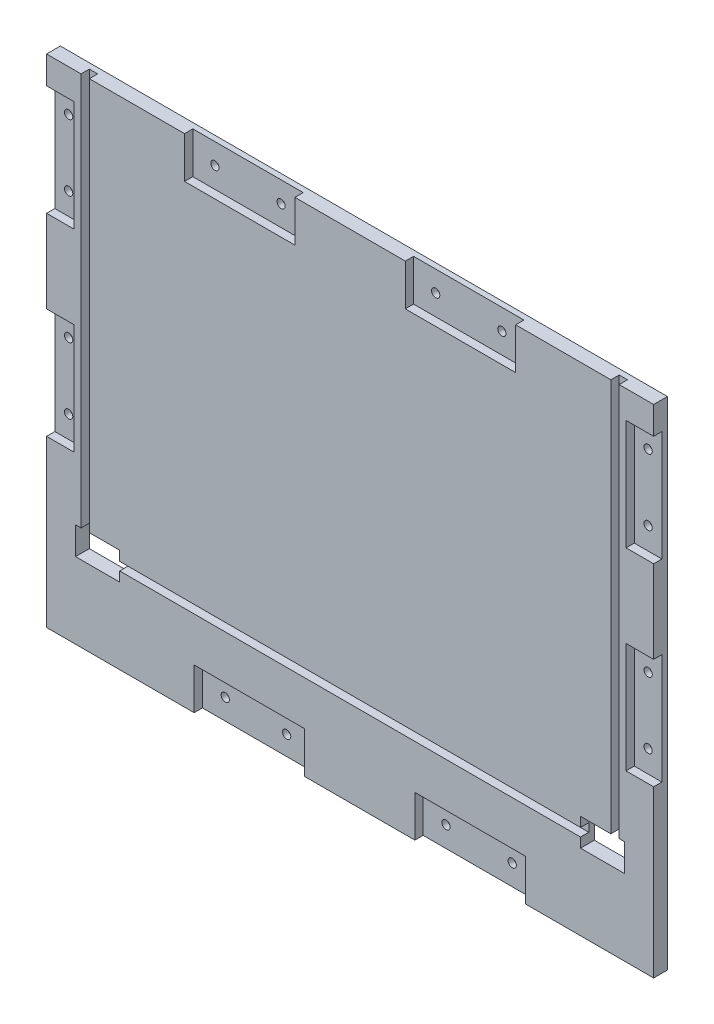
ISO-10303-21;
HEADER;
FILE_DESCRIPTION(('STEP AP214'),'2;1');
FILE_NAME('part.step','',(''),(''),'','','');
FILE_SCHEMA(('AUTOMOTIVE_DESIGN { 1 0 10303 214 1 1 1 1 }'));
ENDSEC;
DATA;
#1=APPLICATION_CONTEXT('core data for automotive mechanical design processes');
#2=APPLICATION_PROTOCOL_DEFINITION('international standard','automotive_design',2000,#1);
#3=PRODUCT_CONTEXT('',#1,'mechanical');
#4=PRODUCT('Part','Part','',(#3));
#5=PRODUCT_RELATED_PRODUCT_CATEGORY('part','',(#4));
#6=PRODUCT_DEFINITION_FORMATION('','',#4);
#7=PRODUCT_DEFINITION_CONTEXT('part definition',#1,'design');
#8=PRODUCT_DEFINITION('design','',#6,#7);
#9=PRODUCT_DEFINITION_SHAPE('','',#8);
#10=(LENGTH_UNIT() NAMED_UNIT(*) SI_UNIT(.MILLI.,.METRE.));
#11=(NAMED_UNIT(*) PLANE_ANGLE_UNIT() SI_UNIT($,.RADIAN.));
#12=(NAMED_UNIT(*) SI_UNIT($,.STERADIAN.) SOLID_ANGLE_UNIT());
#13=UNCERTAINTY_MEASURE_WITH_UNIT(LENGTH_MEASURE(1.E-05),#10,'distance_accuracy_value','');
#14=(GEOMETRIC_REPRESENTATION_CONTEXT(3) GLOBAL_UNCERTAINTY_ASSIGNED_CONTEXT((#13)) GLOBAL_UNIT_ASSIGNED_CONTEXT((#10,
#11,#12)) REPRESENTATION_CONTEXT('',''));
#15=CARTESIAN_POINT('',(0.,0.,0.));
#16=DIRECTION('',(0.,0.,1.));
#17=DIRECTION('',(1.,0.,0.));
#18=AXIS2_PLACEMENT_3D('',#15,#16,#17);
#19=CARTESIAN_POINT('',(0.,180.,5.));
#20=DIRECTION('',(0.,0.,-1.));
#21=DIRECTION('',(-1.,0.,0.));
#22=AXIS2_PLACEMENT_3D('',#19,#20,#21);
#23=PLANE('',#22);
#24=DIRECTION('',(0.,-1.,0.));
#25=VECTOR('',#24,1.);
#26=CARTESIAN_POINT('',(0.,0.,5.));
#27=LINE('',#26,#25);
#28=CARTESIAN_POINT('',(0.,180.,5.));
#29=VERTEX_POINT('',#28);
#30=CARTESIAN_POINT('',(0.,170.,5.));
#31=VERTEX_POINT('',#30);
#32=EDGE_CURVE('E606',#29,#31,#27,.T.);
#33=ORIENTED_EDGE('',*,*,#32,.T.);
#34=DIRECTION('',(-1.,0.,0.));
#35=VECTOR('',#34,1.);
#36=CARTESIAN_POINT('',(0.,170.,5.));
#37=LINE('',#36,#35);
#38=CARTESIAN_POINT('',(10.0000000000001,170.,5.));
#39=VERTEX_POINT('',#38);
#40=EDGE_CURVE('E1361',#39,#31,#37,.T.);
#41=ORIENTED_EDGE('',*,*,#40,.F.);
#42=DIRECTION('',(0.,1.,0.));
#43=VECTOR('',#42,1.);
#44=CARTESIAN_POINT('',(10.0000000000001,170.,5.));
#45=LINE('',#44,#43);
#46=CARTESIAN_POINT('',(10.0000000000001,130.,5.));
#47=VERTEX_POINT('',#46);
#48=EDGE_CURVE('E1369',#47,#39,#45,.T.);
#49=ORIENTED_EDGE('',*,*,#48,.F.);
#50=DIRECTION('',(1.,0.,0.));
#51=VECTOR('',#50,1.);
#52=CARTESIAN_POINT('',(0.,130.,5.));
#53=LINE('',#52,#51);
#54=CARTESIAN_POINT('',(0.,130.,5.));
#55=VERTEX_POINT('',#54);
#56=EDGE_CURVE('E1366',#55,#47,#53,.T.);
#57=ORIENTED_EDGE('',*,*,#56,.F.);
#58=CARTESIAN_POINT('',(0.,99.9999999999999,5.));
#59=VERTEX_POINT('',#58);
#60=EDGE_CURVE('E610',#55,#59,#27,.T.);
#61=ORIENTED_EDGE('',*,*,#60,.T.);
#62=DIRECTION('',(-1.,0.,0.));
#63=VECTOR('',#62,1.);
#64=CARTESIAN_POINT('',(0.,99.9999999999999,5.));
#65=LINE('',#64,#63);
#66=CARTESIAN_POINT('',(10.0000000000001,100.,5.));
#67=VERTEX_POINT('',#66);
#68=EDGE_CURVE('E1395',#67,#59,#65,.T.);
#69=ORIENTED_EDGE('',*,*,#68,.F.);
#70=DIRECTION('',(0.,1.,0.));
#71=VECTOR('',#70,1.);
#72=CARTESIAN_POINT('',(10.0000000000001,60.,5.));
#73=LINE('',#72,#71);
#74=CARTESIAN_POINT('',(10.0000000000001,60.,5.));
#75=VERTEX_POINT('',#74);
#76=EDGE_CURVE('E1392',#75,#67,#73,.T.);
#77=ORIENTED_EDGE('',*,*,#76,.F.);
#78=DIRECTION('',(1.,0.,0.));
#79=VECTOR('',#78,1.);
#80=CARTESIAN_POINT('',(0.,59.9999999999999,5.));
#81=LINE('',#80,#79);
#82=CARTESIAN_POINT('',(0.,59.9999999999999,5.));
#83=VERTEX_POINT('',#82);
#84=EDGE_CURVE('E1383',#83,#75,#81,.T.);
#85=ORIENTED_EDGE('',*,*,#84,.F.);
#86=CARTESIAN_POINT('',(0.,0.,5.));
#87=VERTEX_POINT('',#86);
#88=EDGE_CURVE('E605',#83,#87,#27,.T.);
#89=ORIENTED_EDGE('',*,*,#88,.T.);
#90=DIRECTION('',(1.,0.,0.));
#91=VECTOR('',#90,1.);
#92=CARTESIAN_POINT('',(0.,0.,5.));
#93=LINE('',#92,#91);
#94=CARTESIAN_POINT('',(53.4813992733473,0.,5.));
#95=VERTEX_POINT('',#94);
#96=EDGE_CURVE('E611',#87,#95,#93,.T.);
#97=ORIENTED_EDGE('',*,*,#96,.T.);
#98=DIRECTION('',(0.,-1.,0.));
#99=VECTOR('',#98,1.);
#100=CARTESIAN_POINT('',(53.4813992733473,15.,5.));
#101=LINE('',#100,#99);
#102=CARTESIAN_POINT('',(53.4813992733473,15.,5.));
#103=VERTEX_POINT('',#102);
#104=EDGE_CURVE('E1421',#103,#95,#101,.T.);
#105=ORIENTED_EDGE('',*,*,#104,.F.);
#106=DIRECTION('',(-1.,0.,0.));
#107=VECTOR('',#106,1.);
#108=CARTESIAN_POINT('',(93.4813992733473,15.,5.));
#109=LINE('',#108,#107);
#110=CARTESIAN_POINT('',(93.4813992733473,15.,5.));
#111=VERTEX_POINT('',#110);
#112=EDGE_CURVE('E1413',#111,#103,#109,.T.);
#113=ORIENTED_EDGE('',*,*,#112,.F.);
#114=DIRECTION('',(0.,1.,0.));
#115=VECTOR('',#114,1.);
#116=CARTESIAN_POINT('',(93.4813992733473,15.,5.));
#117=LINE('',#116,#115);
#118=CARTESIAN_POINT('',(93.4813992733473,0.,5.));
#119=VERTEX_POINT('',#118);
#120=EDGE_CURVE('E1423',#119,#111,#117,.T.);
#121=ORIENTED_EDGE('',*,*,#120,.F.);
#122=CARTESIAN_POINT('',(133.481399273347,0.,5.));
#123=VERTEX_POINT('',#122);
#124=EDGE_CURVE('E614',#119,#123,#93,.T.);
#125=ORIENTED_EDGE('',*,*,#124,.T.);
#126=DIRECTION('',(0.,-1.,0.));
#127=VECTOR('',#126,1.);
#128=CARTESIAN_POINT('',(133.481399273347,15.,5.));
#129=LINE('',#128,#127);
#130=CARTESIAN_POINT('',(133.481399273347,15.,5.));
#131=VERTEX_POINT('',#130);
#132=EDGE_CURVE('E1439',#131,#123,#129,.T.);
#133=ORIENTED_EDGE('',*,*,#132,.F.);
#134=DIRECTION('',(-1.,0.,0.));
#135=VECTOR('',#134,1.);
#136=CARTESIAN_POINT('',(133.481399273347,15.,5.));
#137=LINE('',#136,#135);
#138=CARTESIAN_POINT('',(173.481399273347,15.,5.));
#139=VERTEX_POINT('',#138);
#140=EDGE_CURVE('E1447',#139,#131,#137,.T.);
#141=ORIENTED_EDGE('',*,*,#140,.F.);
#142=DIRECTION('',(0.,1.,0.));
#143=VECTOR('',#142,1.);
#144=CARTESIAN_POINT('',(173.481399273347,15.,5.));
#145=LINE('',#144,#143);
#146=CARTESIAN_POINT('',(173.481399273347,0.,5.));
#147=VERTEX_POINT('',#146);
#148=EDGE_CURVE('E739',#147,#139,#145,.T.);
#149=ORIENTED_EDGE('',*,*,#148,.F.);
#150=CARTESIAN_POINT('',(220.,0.,5.));
#151=VERTEX_POINT('',#150);
#152=EDGE_CURVE('E609',#147,#151,#93,.T.);
#153=ORIENTED_EDGE('',*,*,#152,.T.);
#154=DIRECTION('',(0.,1.,0.));
#155=VECTOR('',#154,1.);
#156=CARTESIAN_POINT('',(220.,0.,5.));
#157=LINE('',#156,#155);
#158=CARTESIAN_POINT('',(220.,60.,5.));
#159=VERTEX_POINT('',#158);
#160=EDGE_CURVE('E418',#151,#159,#157,.T.);
#161=ORIENTED_EDGE('',*,*,#160,.T.);
#162=DIRECTION('',(1.,0.,0.));
#163=VECTOR('',#162,1.);
#164=CARTESIAN_POINT('',(220.,60.,5.));
#165=LINE('',#164,#163);
#166=CARTESIAN_POINT('',(210.,60.,5.));
#167=VERTEX_POINT('',#166);
#168=EDGE_CURVE('E1463',#167,#159,#165,.T.);
#169=ORIENTED_EDGE('',*,*,#168,.F.);
#170=DIRECTION('',(0.,-1.,0.));
#171=VECTOR('',#170,1.);
#172=CARTESIAN_POINT('',(210.,60.,5.));
#173=LINE('',#172,#171);
#174=CARTESIAN_POINT('',(210.,100.,5.));
#175=VERTEX_POINT('',#174);
#176=EDGE_CURVE('E1473',#175,#167,#173,.T.);
#177=ORIENTED_EDGE('',*,*,#176,.F.);
#178=DIRECTION('',(-1.,0.,0.));
#179=VECTOR('',#178,1.);
#180=CARTESIAN_POINT('',(220.,100.,5.));
#181=LINE('',#180,#179);
#182=CARTESIAN_POINT('',(220.,100.,5.));
#183=VERTEX_POINT('',#182);
#184=EDGE_CURVE('E1470',#183,#175,#181,.T.);
#185=ORIENTED_EDGE('',*,*,#184,.F.);
#186=CARTESIAN_POINT('',(220.,130.,5.));
#187=VERTEX_POINT('',#186);
#188=EDGE_CURVE('E616',#183,#187,#157,.T.);
#189=ORIENTED_EDGE('',*,*,#188,.T.);
#190=DIRECTION('',(1.,0.,0.));
#191=VECTOR('',#190,1.);
#192=CARTESIAN_POINT('',(220.,130.,5.));
#193=LINE('',#192,#191);
#194=CARTESIAN_POINT('',(210.,130.,5.));
#195=VERTEX_POINT('',#194);
#196=EDGE_CURVE('E765',#195,#187,#193,.T.);
#197=ORIENTED_EDGE('',*,*,#196,.F.);
#198=DIRECTION('',(0.,-1.,0.));
#199=VECTOR('',#198,1.);
#200=CARTESIAN_POINT('',(210.,170.,5.));
#201=LINE('',#200,#199);
#202=CARTESIAN_POINT('',(210.,170.,5.));
#203=VERTEX_POINT('',#202);
#204=EDGE_CURVE('E761',#203,#195,#201,.T.);
#205=ORIENTED_EDGE('',*,*,#204,.F.);
#206=DIRECTION('',(-1.,0.,0.));
#207=VECTOR('',#206,1.);
#208=CARTESIAN_POINT('',(220.,170.,5.));
#209=LINE('',#208,#207);
#210=CARTESIAN_POINT('',(220.,170.,5.));
#211=VERTEX_POINT('',#210);
#212=EDGE_CURVE('E624',#211,#203,#209,.T.);
#213=ORIENTED_EDGE('',*,*,#212,.F.);
#214=CARTESIAN_POINT('',(220.,180.,5.));
#215=VERTEX_POINT('',#214);
#216=EDGE_CURVE('E613',#211,#215,#157,.T.);
#217=ORIENTED_EDGE('',*,*,#216,.T.);
#218=DIRECTION('',(-1.,0.,0.));
#219=VECTOR('',#218,1.);
#220=CARTESIAN_POINT('',(0.,180.,5.));
#221=LINE('',#220,#219);
#222=CARTESIAN_POINT('',(207.5,180.,5.));
#223=VERTEX_POINT('',#222);
#224=EDGE_CURVE('E416',#215,#223,#221,.T.);
#225=ORIENTED_EDGE('',*,*,#224,.T.);
#226=DIRECTION('',(0.,1.,0.));
#227=VECTOR('',#226,1.);
#228=CARTESIAN_POINT('',(207.5,37.5,5.));
#229=LINE('',#228,#227);
#230=CARTESIAN_POINT('',(207.5,37.5,5.));
#231=VERTEX_POINT('',#230);
#232=EDGE_CURVE('E480',#231,#223,#229,.T.);
#233=ORIENTED_EDGE('',*,*,#232,.F.);
#234=DIRECTION('',(-1.,0.,0.));
#235=VECTOR('',#234,1.);
#236=CARTESIAN_POINT('',(193.5,37.5,5.));
#237=LINE('',#236,#235);
#238=CARTESIAN_POINT('',(209.5,37.5,5.));
#239=VERTEX_POINT('',#238);
#240=EDGE_CURVE('E583',#239,#231,#237,.T.);
#241=ORIENTED_EDGE('',*,*,#240,.F.);
#242=DIRECTION('',(0.,1.,0.));
#243=VECTOR('',#242,1.);
#244=CARTESIAN_POINT('',(209.5,37.5,5.));
#245=LINE('',#244,#243);
#246=CARTESIAN_POINT('',(209.5,27.5,5.));
#247=VERTEX_POINT('',#246);
#248=EDGE_CURVE('E579',#247,#239,#245,.T.);
#249=ORIENTED_EDGE('',*,*,#248,.F.);
#250=DIRECTION('',(1.,0.,0.));
#251=VECTOR('',#250,1.);
#252=CARTESIAN_POINT('',(193.5,27.5,5.));
#253=LINE('',#252,#251);
#254=CARTESIAN_POINT('',(193.5,27.5,5.));
#255=VERTEX_POINT('',#254);
#256=EDGE_CURVE('E577',#255,#247,#253,.T.);
#257=ORIENTED_EDGE('',*,*,#256,.F.);
#258=DIRECTION('',(0.,-1.,0.));
#259=VECTOR('',#258,1.);
#260=CARTESIAN_POINT('',(193.5,37.5,5.));
#261=LINE('',#260,#259);
#262=CARTESIAN_POINT('',(193.5,31.,5.));
#263=VERTEX_POINT('',#262);
#264=EDGE_CURVE('E573',#263,#255,#261,.T.);
#265=ORIENTED_EDGE('',*,*,#264,.F.);
#266=DIRECTION('',(1.,0.,0.));
#267=VECTOR('',#266,1.);
#268=CARTESIAN_POINT('',(26.5,31.,5.));
#269=LINE('',#268,#267);
#270=CARTESIAN_POINT('',(26.5,31.,5.));
#271=VERTEX_POINT('',#270);
#272=EDGE_CURVE('E495',#271,#263,#269,.T.);
#273=ORIENTED_EDGE('',*,*,#272,.F.);
#274=DIRECTION('',(0.,1.,0.));
#275=VECTOR('',#274,1.);
#276=CARTESIAN_POINT('',(26.5,37.5,5.));
#277=LINE('',#276,#275);
#278=CARTESIAN_POINT('',(26.5,27.5,5.));
#279=VERTEX_POINT('',#278);
#280=EDGE_CURVE('E548',#279,#271,#277,.T.);
#281=ORIENTED_EDGE('',*,*,#280,.F.);
#282=DIRECTION('',(1.,0.,0.));
#283=VECTOR('',#282,1.);
#284=CARTESIAN_POINT('',(26.5,27.5,5.));
#285=LINE('',#284,#283);
#286=CARTESIAN_POINT('',(10.5,27.5,5.));
#287=VERTEX_POINT('',#286);
#288=EDGE_CURVE('E544',#287,#279,#285,.T.);
#289=ORIENTED_EDGE('',*,*,#288,.F.);
#290=DIRECTION('',(0.,-1.,0.));
#291=VECTOR('',#290,1.);
#292=CARTESIAN_POINT('',(10.5,37.5,5.));
#293=LINE('',#292,#291);
#294=CARTESIAN_POINT('',(10.5,37.5,5.));
#295=VERTEX_POINT('',#294);
#296=EDGE_CURVE('E542',#295,#287,#293,.T.);
#297=ORIENTED_EDGE('',*,*,#296,.F.);
#298=DIRECTION('',(-1.,0.,0.));
#299=VECTOR('',#298,1.);
#300=CARTESIAN_POINT('',(26.5,37.5,5.));
#301=LINE('',#300,#299);
#302=CARTESIAN_POINT('',(12.5,37.5,5.));
#303=VERTEX_POINT('',#302);
#304=EDGE_CURVE('E538',#303,#295,#301,.T.);
#305=ORIENTED_EDGE('',*,*,#304,.F.);
#306=DIRECTION('',(0.,-1.,0.));
#307=VECTOR('',#306,1.);
#308=CARTESIAN_POINT('',(12.5,37.5,5.));
#309=LINE('',#308,#307);
#310=CARTESIAN_POINT('',(12.5,180.,5.));
#311=VERTEX_POINT('',#310);
#312=EDGE_CURVE('E459',#311,#303,#309,.T.);
#313=ORIENTED_EDGE('',*,*,#312,.F.);
#314=EDGE_CURVE('E414',#311,#29,#221,.T.);
#315=ORIENTED_EDGE('',*,*,#314,.T.);
#316=EDGE_LOOP('',(#33,#41,#49,#57,#61,#69,#77,#85,#89,#97,#105,#113,#121,#125,#133,#141,#149,
#153,#161,#169,#177,#185,#189,#197,#205,#213,#217,#225,#233,#241,#249,#257,#265,#273,#281,#289,
#297,#305,#313,#315));
#317=FACE_BOUND('',#316,.T.);
#318=ADVANCED_FACE('F27',(#317),#23,.F.);
#319=CARTESIAN_POINT('',(130.,180.,5.));
#320=VERTEX_POINT('',#319);
#321=CARTESIAN_POINT('',(90.,180.,5.));
#322=VERTEX_POINT('',#321);
#323=EDGE_CURVE('E413',#320,#322,#221,.T.);
#324=ORIENTED_EDGE('',*,*,#323,.T.);
#325=DIRECTION('',(0.,1.,0.));
#326=VECTOR('',#325,1.);
#327=CARTESIAN_POINT('',(90.,180.,5.));
#328=LINE('',#327,#326);
#329=CARTESIAN_POINT('',(90.,165.,5.));
#330=VERTEX_POINT('',#329);
#331=EDGE_CURVE('E1351',#330,#322,#328,.T.);
#332=ORIENTED_EDGE('',*,*,#331,.F.);
#333=DIRECTION('',(1.,0.,0.));
#334=VECTOR('',#333,1.);
#335=CARTESIAN_POINT('',(90.,165.,5.));
#336=LINE('',#335,#334);
#337=CARTESIAN_POINT('',(50.,165.,5.));
#338=VERTEX_POINT('',#337);
#339=EDGE_CURVE('E406',#338,#330,#336,.T.);
#340=ORIENTED_EDGE('',*,*,#339,.F.);
#341=DIRECTION('',(0.,-1.,0.));
#342=VECTOR('',#341,1.);
#343=CARTESIAN_POINT('',(50.,180.,5.));
#344=LINE('',#343,#342);
#345=CARTESIAN_POINT('',(50.,180.,5.));
#346=VERTEX_POINT('',#345);
#347=EDGE_CURVE('E389',#346,#338,#344,.T.);
#348=ORIENTED_EDGE('',*,*,#347,.F.);
#349=CARTESIAN_POINT('',(15.5,180.,5.));
#350=VERTEX_POINT('',#349);
#351=EDGE_CURVE('E402',#346,#350,#221,.T.);
#352=ORIENTED_EDGE('',*,*,#351,.T.);
#353=DIRECTION('',(0.,1.,0.));
#354=VECTOR('',#353,1.);
#355=CARTESIAN_POINT('',(15.5,37.5,5.));
#356=LINE('',#355,#354);
#357=CARTESIAN_POINT('',(15.5,37.5,5.));
#358=VERTEX_POINT('',#357);
#359=EDGE_CURVE('E451',#358,#350,#356,.T.);
#360=ORIENTED_EDGE('',*,*,#359,.F.);
#361=CARTESIAN_POINT('',(26.5,37.5,5.));
#362=VERTEX_POINT('',#361);
#363=EDGE_CURVE('E539',#362,#358,#301,.T.);
#364=ORIENTED_EDGE('',*,*,#363,.F.);
#365=CARTESIAN_POINT('',(26.5,34.,5.));
#366=VERTEX_POINT('',#365);
#367=EDGE_CURVE('E547',#366,#362,#277,.T.);
#368=ORIENTED_EDGE('',*,*,#367,.F.);
#369=DIRECTION('',(-1.,0.,0.));
#370=VECTOR('',#369,1.);
#371=CARTESIAN_POINT('',(26.5,34.,5.));
#372=LINE('',#371,#370);
#373=CARTESIAN_POINT('',(193.5,34.,5.));
#374=VERTEX_POINT('',#373);
#375=EDGE_CURVE('E504',#374,#366,#372,.T.);
#376=ORIENTED_EDGE('',*,*,#375,.F.);
#377=CARTESIAN_POINT('',(193.5,37.5,5.));
#378=VERTEX_POINT('',#377);
#379=EDGE_CURVE('E574',#378,#374,#261,.T.);
#380=ORIENTED_EDGE('',*,*,#379,.F.);
#381=CARTESIAN_POINT('',(204.5,37.5,5.));
#382=VERTEX_POINT('',#381);
#383=EDGE_CURVE('E582',#382,#378,#237,.T.);
#384=ORIENTED_EDGE('',*,*,#383,.F.);
#385=DIRECTION('',(0.,-1.,0.));
#386=VECTOR('',#385,1.);
#387=CARTESIAN_POINT('',(204.5,37.5,5.));
#388=LINE('',#387,#386);
#389=CARTESIAN_POINT('',(204.5,180.,5.));
#390=VERTEX_POINT('',#389);
#391=EDGE_CURVE('E435',#390,#382,#388,.T.);
#392=ORIENTED_EDGE('',*,*,#391,.F.);
#393=CARTESIAN_POINT('',(170.,180.,5.));
#394=VERTEX_POINT('',#393);
#395=EDGE_CURVE('E417',#390,#394,#221,.T.);
#396=ORIENTED_EDGE('',*,*,#395,.T.);
#397=DIRECTION('',(0.,1.,0.));
#398=VECTOR('',#397,1.);
#399=CARTESIAN_POINT('',(170.,180.,5.));
#400=LINE('',#399,#398);
#401=CARTESIAN_POINT('',(170.,165.,5.));
#402=VERTEX_POINT('',#401);
#403=EDGE_CURVE('E433',#402,#394,#400,.T.);
#404=ORIENTED_EDGE('',*,*,#403,.F.);
#405=DIRECTION('',(1.,0.,0.));
#406=VECTOR('',#405,1.);
#407=CARTESIAN_POINT('',(130.,165.,5.));
#408=LINE('',#407,#406);
#409=CARTESIAN_POINT('',(130.,165.,5.));
#410=VERTEX_POINT('',#409);
#411=EDGE_CURVE('E791',#410,#402,#408,.T.);
#412=ORIENTED_EDGE('',*,*,#411,.F.);
#413=DIRECTION('',(0.,-1.,0.));
#414=VECTOR('',#413,1.);
#415=CARTESIAN_POINT('',(130.,180.,5.));
#416=LINE('',#415,#414);
#417=EDGE_CURVE('E783',#320,#410,#416,.T.);
#418=ORIENTED_EDGE('',*,*,#417,.F.);
#419=EDGE_LOOP('',(#324,#332,#340,#348,#352,#360,#364,#368,#376,#380,#384,#392,#396,#404,#412,#418));
#420=FACE_BOUND('',#419,.T.);
#421=ADVANCED_FACE('F400',(#420),#23,.F.);
#422=CARTESIAN_POINT('',(0.,180.,0.));
#423=DIRECTION('',(0.,0.,-1.));
#424=DIRECTION('',(-1.,0.,0.));
#425=AXIS2_PLACEMENT_3D('',#422,#423,#424);
#426=PLANE('',#425);
#427=CARTESIAN_POINT('',(82.,172.5,0.));
#428=DIRECTION('',(0.,0.,1.));
#429=DIRECTION('',(-1.,0.,0.));
#430=AXIS2_PLACEMENT_3D('',#427,#428,#429);
#431=CIRCLE('',#430,1.5);
#432=CARTESIAN_POINT('',(80.5,172.5,0.));
#433=VERTEX_POINT('',#432);
#434=EDGE_CURVE('E1288',#433,#433,#431,.T.);
#435=ORIENTED_EDGE('',*,*,#434,.T.);
#436=EDGE_LOOP('',(#435));
#437=FACE_BOUND('',#436,.T.);
#438=CARTESIAN_POINT('',(58.,172.5,0.));
#439=DIRECTION('',(0.,0.,1.));
#440=DIRECTION('',(1.,0.,0.));
#441=AXIS2_PLACEMENT_3D('',#438,#439,#440);
#442=CIRCLE('',#441,1.5);
#443=CARTESIAN_POINT('',(59.5,172.5,0.));
#444=VERTEX_POINT('',#443);
#445=EDGE_CURVE('E1290',#444,#444,#442,.T.);
#446=ORIENTED_EDGE('',*,*,#445,.T.);
#447=EDGE_LOOP('',(#446));
#448=FACE_BOUND('',#447,.T.);
#449=CARTESIAN_POINT('',(5.00000000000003,162.,0.));
#450=DIRECTION('',(0.,0.,1.));
#451=DIRECTION('',(1.,0.,0.));
#452=AXIS2_PLACEMENT_3D('',#449,#450,#451);
#453=CIRCLE('',#452,1.5);
#454=CARTESIAN_POINT('',(6.50000000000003,162.,0.));
#455=VERTEX_POINT('',#454);
#456=EDGE_CURVE('E1295',#455,#455,#453,.T.);
#457=ORIENTED_EDGE('',*,*,#456,.T.);
#458=EDGE_LOOP('',(#457));
#459=FACE_BOUND('',#458,.T.);
#460=CARTESIAN_POINT('',(5.00000000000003,138.,0.));
#461=DIRECTION('',(0.,0.,1.));
#462=DIRECTION('',(-1.,0.,0.));
#463=AXIS2_PLACEMENT_3D('',#460,#461,#462);
#464=CIRCLE('',#463,1.5);
#465=CARTESIAN_POINT('',(3.50000000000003,138.,0.));
#466=VERTEX_POINT('',#465);
#467=EDGE_CURVE('E1299',#466,#466,#464,.T.);
#468=ORIENTED_EDGE('',*,*,#467,.T.);
#469=EDGE_LOOP('',(#468));
#470=FACE_BOUND('',#469,.T.);
#471=CARTESIAN_POINT('',(5.00000000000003,91.9999999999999,0.));
#472=DIRECTION('',(0.,0.,1.));
#473=DIRECTION('',(1.,0.,0.));
#474=AXIS2_PLACEMENT_3D('',#471,#472,#473);
#475=CIRCLE('',#474,1.5);
#476=CARTESIAN_POINT('',(6.50000000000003,91.9999999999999,0.));
#477=VERTEX_POINT('',#476);
#478=EDGE_CURVE('E1303',#477,#477,#475,.T.);
#479=ORIENTED_EDGE('',*,*,#478,.T.);
#480=EDGE_LOOP('',(#479));
#481=FACE_BOUND('',#480,.T.);
#482=CARTESIAN_POINT('',(5.00000000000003,68.,0.));
#483=DIRECTION('',(0.,0.,1.));
#484=DIRECTION('',(-1.,0.,0.));
#485=AXIS2_PLACEMENT_3D('',#482,#483,#484);
#486=CIRCLE('',#485,1.5);
#487=CARTESIAN_POINT('',(3.50000000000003,68.,0.));
#488=VERTEX_POINT('',#487);
#489=EDGE_CURVE('E1307',#488,#488,#486,.T.);
#490=ORIENTED_EDGE('',*,*,#489,.T.);
#491=EDGE_LOOP('',(#490));
#492=FACE_BOUND('',#491,.T.);
#493=CARTESIAN_POINT('',(84.,7.,0.));
#494=DIRECTION('',(0.,0.,1.));
#495=DIRECTION('',(-1.,0.,0.));
#496=AXIS2_PLACEMENT_3D('',#493,#494,#495);
#497=CIRCLE('',#496,1.5);
#498=CARTESIAN_POINT('',(82.5,7.,0.));
#499=VERTEX_POINT('',#498);
#500=EDGE_CURVE('E1311',#499,#499,#497,.T.);
#501=ORIENTED_EDGE('',*,*,#500,.T.);
#502=EDGE_LOOP('',(#501));
#503=FACE_BOUND('',#502,.T.);
#504=CARTESIAN_POINT('',(61.7537202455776,7.47964397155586,0.));
#505=DIRECTION('',(0.,0.,1.));
#506=DIRECTION('',(1.,0.,0.));
#507=AXIS2_PLACEMENT_3D('',#504,#505,#506);
#508=CIRCLE('',#507,1.5);
#509=CARTESIAN_POINT('',(63.2537202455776,7.47964397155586,0.));
#510=VERTEX_POINT('',#509);
#511=EDGE_CURVE('E1315',#510,#510,#508,.T.);
#512=ORIENTED_EDGE('',*,*,#511,.T.);
#513=EDGE_LOOP('',(#512));
#514=FACE_BOUND('',#513,.T.);
#515=CARTESIAN_POINT('',(165.753720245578,7.47964397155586,0.));
#516=DIRECTION('',(0.,0.,1.));
#517=DIRECTION('',(-1.,0.,0.));
#518=AXIS2_PLACEMENT_3D('',#515,#516,#517);
#519=CIRCLE('',#518,1.5);
#520=CARTESIAN_POINT('',(164.253720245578,7.47964397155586,0.));
#521=VERTEX_POINT('',#520);
#522=EDGE_CURVE('E1319',#521,#521,#519,.T.);
#523=ORIENTED_EDGE('',*,*,#522,.T.);
#524=EDGE_LOOP('',(#523));
#525=FACE_BOUND('',#524,.T.);
#526=CARTESIAN_POINT('',(141.753720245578,7.47964397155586,0.));
#527=DIRECTION('',(0.,0.,1.));
#528=DIRECTION('',(1.,0.,0.));
#529=AXIS2_PLACEMENT_3D('',#526,#527,#528);
#530=CIRCLE('',#529,1.5);
#531=CARTESIAN_POINT('',(143.253720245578,7.47964397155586,0.));
#532=VERTEX_POINT('',#531);
#533=EDGE_CURVE('E1323',#532,#532,#530,.T.);
#534=ORIENTED_EDGE('',*,*,#533,.T.);
#535=EDGE_LOOP('',(#534));
#536=FACE_BOUND('',#535,.T.);
#537=CARTESIAN_POINT('',(215.,67.9999999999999,0.));
#538=DIRECTION('',(0.,0.,1.));
#539=DIRECTION('',(1.,0.,0.));
#540=AXIS2_PLACEMENT_3D('',#537,#538,#539);
#541=CIRCLE('',#540,1.5);
#542=CARTESIAN_POINT('',(216.5,67.9999999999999,0.));
#543=VERTEX_POINT('',#542);
#544=EDGE_CURVE('E1327',#543,#543,#541,.T.);
#545=ORIENTED_EDGE('',*,*,#544,.T.);
#546=EDGE_LOOP('',(#545));
#547=FACE_BOUND('',#546,.T.);
#548=CARTESIAN_POINT('',(215.,92.,0.));
#549=DIRECTION('',(0.,0.,1.));
#550=DIRECTION('',(-1.,0.,0.));
#551=AXIS2_PLACEMENT_3D('',#548,#549,#550);
#552=CIRCLE('',#551,1.5);
#553=CARTESIAN_POINT('',(213.5,92.,0.));
#554=VERTEX_POINT('',#553);
#555=EDGE_CURVE('E1331',#554,#554,#552,.T.);
#556=ORIENTED_EDGE('',*,*,#555,.T.);
#557=EDGE_LOOP('',(#556));
#558=FACE_BOUND('',#557,.T.);
#559=CARTESIAN_POINT('',(215.,138.,0.));
#560=DIRECTION('',(0.,0.,1.));
#561=DIRECTION('',(1.,0.,0.));
#562=AXIS2_PLACEMENT_3D('',#559,#560,#561);
#563=CIRCLE('',#562,1.5);
#564=CARTESIAN_POINT('',(216.5,138.,0.));
#565=VERTEX_POINT('',#564);
#566=EDGE_CURVE('E1335',#565,#565,#563,.T.);
#567=ORIENTED_EDGE('',*,*,#566,.T.);
#568=EDGE_LOOP('',(#567));
#569=FACE_BOUND('',#568,.T.);
#570=CARTESIAN_POINT('',(215.,162.,0.));
#571=DIRECTION('',(0.,0.,1.));
#572=DIRECTION('',(-1.,0.,0.));
#573=AXIS2_PLACEMENT_3D('',#570,#571,#572);
#574=CIRCLE('',#573,1.5);
#575=CARTESIAN_POINT('',(213.5,162.,0.));
#576=VERTEX_POINT('',#575);
#577=EDGE_CURVE('E1339',#576,#576,#574,.T.);
#578=ORIENTED_EDGE('',*,*,#577,.T.);
#579=EDGE_LOOP('',(#578));
#580=FACE_BOUND('',#579,.T.);
#581=CARTESIAN_POINT('',(162.,172.5,0.));
#582=DIRECTION('',(0.,0.,1.));
#583=DIRECTION('',(-1.,0.,0.));
#584=AXIS2_PLACEMENT_3D('',#581,#582,#583);
#585=CIRCLE('',#584,1.5);
#586=CARTESIAN_POINT('',(160.5,172.5,0.));
#587=VERTEX_POINT('',#586);
#588=EDGE_CURVE('E1343',#587,#587,#585,.T.);
#589=ORIENTED_EDGE('',*,*,#588,.T.);
#590=EDGE_LOOP('',(#589));
#591=FACE_BOUND('',#590,.T.);
#592=CARTESIAN_POINT('',(138.,172.5,0.));
#593=DIRECTION('',(0.,0.,1.));
#594=DIRECTION('',(1.,0.,0.));
#595=AXIS2_PLACEMENT_3D('',#592,#593,#594);
#596=CIRCLE('',#595,1.5);
#597=CARTESIAN_POINT('',(139.5,172.5,0.));
#598=VERTEX_POINT('',#597);
#599=EDGE_CURVE('E1347',#598,#598,#596,.T.);
#600=ORIENTED_EDGE('',*,*,#599,.T.);
#601=EDGE_LOOP('',(#600));
#602=FACE_BOUND('',#601,.T.);
#603=DIRECTION('',(-1.,0.,0.));
#604=VECTOR('',#603,1.);
#605=CARTESIAN_POINT('',(193.5,37.5,0.));
#606=LINE('',#605,#604);
#607=CARTESIAN_POINT('',(209.5,37.5,0.));
#608=VERTEX_POINT('',#607);
#609=CARTESIAN_POINT('',(193.5,37.5,0.));
#610=VERTEX_POINT('',#609);
#611=EDGE_CURVE('E570',#608,#610,#606,.T.);
#612=ORIENTED_EDGE('',*,*,#611,.T.);
#613=DIRECTION('',(0.,-1.,0.));
#614=VECTOR('',#613,1.);
#615=CARTESIAN_POINT('',(193.5,37.5,0.));
#616=LINE('',#615,#614);
#617=CARTESIAN_POINT('',(193.5,27.5,0.));
#618=VERTEX_POINT('',#617);
#619=EDGE_CURVE('E561',#610,#618,#616,.T.);
#620=ORIENTED_EDGE('',*,*,#619,.T.);
#621=DIRECTION('',(1.,0.,0.));
#622=VECTOR('',#621,1.);
#623=CARTESIAN_POINT('',(193.5,27.5,0.));
#624=LINE('',#623,#622);
#625=CARTESIAN_POINT('',(209.5,27.5,0.));
#626=VERTEX_POINT('',#625);
#627=EDGE_CURVE('E564',#618,#626,#624,.T.);
#628=ORIENTED_EDGE('',*,*,#627,.T.);
#629=DIRECTION('',(0.,1.,0.));
#630=VECTOR('',#629,1.);
#631=CARTESIAN_POINT('',(209.5,37.5,0.));
#632=LINE('',#631,#630);
#633=EDGE_CURVE('E567',#626,#608,#632,.T.);
#634=ORIENTED_EDGE('',*,*,#633,.T.);
#635=EDGE_LOOP('',(#612,#620,#628,#634));
#636=FACE_BOUND('',#635,.T.);
#637=DIRECTION('',(0.,-1.,0.));
#638=VECTOR('',#637,1.);
#639=CARTESIAN_POINT('',(0.,0.,0.));
#640=LINE('',#639,#638);
#641=CARTESIAN_POINT('',(0.,180.,0.));
#642=VERTEX_POINT('',#641);
#643=CARTESIAN_POINT('',(0.,0.,0.));
#644=VERTEX_POINT('',#643);
#645=EDGE_CURVE('E596',#642,#644,#640,.T.);
#646=ORIENTED_EDGE('',*,*,#645,.F.);
#647=DIRECTION('',(-1.,0.,0.));
#648=VECTOR('',#647,1.);
#649=CARTESIAN_POINT('',(0.,180.,0.));
#650=LINE('',#649,#648);
#651=CARTESIAN_POINT('',(220.,180.,0.));
#652=VERTEX_POINT('',#651);
#653=EDGE_CURVE('E603',#652,#642,#650,.T.);
#654=ORIENTED_EDGE('',*,*,#653,.F.);
#655=DIRECTION('',(0.,1.,0.));
#656=VECTOR('',#655,1.);
#657=CARTESIAN_POINT('',(220.,0.,0.));
#658=LINE('',#657,#656);
#659=CARTESIAN_POINT('',(220.,0.,0.));
#660=VERTEX_POINT('',#659);
#661=EDGE_CURVE('E601',#660,#652,#658,.T.);
#662=ORIENTED_EDGE('',*,*,#661,.F.);
#663=DIRECTION('',(1.,0.,0.));
#664=VECTOR('',#663,1.);
#665=CARTESIAN_POINT('',(0.,0.,0.));
#666=LINE('',#665,#664);
#667=EDGE_CURVE('E599',#644,#660,#666,.T.);
#668=ORIENTED_EDGE('',*,*,#667,.F.);
#669=EDGE_LOOP('',(#646,#654,#662,#668));
#670=FACE_BOUND('',#669,.T.);
#671=DIRECTION('',(0.,1.,0.));
#672=VECTOR('',#671,1.);
#673=CARTESIAN_POINT('',(26.5,37.5,0.));
#674=LINE('',#673,#672);
#675=CARTESIAN_POINT('',(26.5,27.5,0.));
#676=VERTEX_POINT('',#675);
#677=CARTESIAN_POINT('',(26.5,37.5,0.));
#678=VERTEX_POINT('',#677);
#679=EDGE_CURVE('E535',#676,#678,#674,.T.);
#680=ORIENTED_EDGE('',*,*,#679,.T.);
#681=DIRECTION('',(-1.,0.,0.));
#682=VECTOR('',#681,1.);
#683=CARTESIAN_POINT('',(26.5,37.5,0.));
#684=LINE('',#683,#682);
#685=CARTESIAN_POINT('',(10.5,37.5,0.));
#686=VERTEX_POINT('',#685);
#687=EDGE_CURVE('E520',#678,#686,#684,.T.);
#688=ORIENTED_EDGE('',*,*,#687,.T.);
#689=DIRECTION('',(0.,-1.,0.));
#690=VECTOR('',#689,1.);
#691=CARTESIAN_POINT('',(10.5,37.5,0.));
#692=LINE('',#691,#690);
#693=CARTESIAN_POINT('',(10.5,27.5,0.));
#694=VERTEX_POINT('',#693);
#695=EDGE_CURVE('E529',#686,#694,#692,.T.);
#696=ORIENTED_EDGE('',*,*,#695,.T.);
#697=DIRECTION('',(1.,0.,0.));
#698=VECTOR('',#697,1.);
#699=CARTESIAN_POINT('',(26.5,27.5,0.));
#700=LINE('',#699,#698);
#701=EDGE_CURVE('E532',#694,#676,#700,.T.);
#702=ORIENTED_EDGE('',*,*,#701,.T.);
#703=EDGE_LOOP('',(#680,#688,#696,#702));
#704=FACE_BOUND('',#703,.T.);
#705=ADVANCED_FACE('F660',(#437,#448,#459,#470,#481,#492,#503,#514,#525,#536,#547,#558,#569,
#580,#591,#602,#636,#670,#704),#426,.T.);
#706=CARTESIAN_POINT('',(0.,0.,5.));
#707=DIRECTION('',(1.,0.,0.));
#708=DIRECTION('',(0.,0.,-1.));
#709=AXIS2_PLACEMENT_3D('',#706,#707,#708);
#710=PLANE('',#709);
#711=DIRECTION('',(0.,-1.,0.));
#712=VECTOR('',#711,1.);
#713=CARTESIAN_POINT('',(0.,170.,2.));
#714=LINE('',#713,#712);
#715=CARTESIAN_POINT('',(0.,170.,2.));
#716=VERTEX_POINT('',#715);
#717=CARTESIAN_POINT('',(0.,130.,2.));
#718=VERTEX_POINT('',#717);
#719=EDGE_CURVE('E1373',#716,#718,#714,.T.);
#720=ORIENTED_EDGE('',*,*,#719,.F.);
#721=DIRECTION('',(0.,0.,1.));
#722=VECTOR('',#721,1.);
#723=CARTESIAN_POINT('',(0.,170.,2.));
#724=LINE('',#723,#722);
#725=EDGE_CURVE('E1380',#716,#31,#724,.T.);
#726=ORIENTED_EDGE('',*,*,#725,.T.);
#727=ORIENTED_EDGE('',*,*,#32,.F.);
#728=DIRECTION('',(0.,0.,-1.));
#729=VECTOR('',#728,1.);
#730=CARTESIAN_POINT('',(0.,180.,5.));
#731=LINE('',#730,#729);
#732=EDGE_CURVE('E422',#29,#642,#731,.T.);
#733=ORIENTED_EDGE('',*,*,#732,.T.);
#734=ORIENTED_EDGE('',*,*,#645,.T.);
#735=DIRECTION('',(0.,0.,-1.));
#736=VECTOR('',#735,1.);
#737=CARTESIAN_POINT('',(0.,0.,5.));
#738=LINE('',#737,#736);
#739=EDGE_CURVE('E11',#87,#644,#738,.T.);
#740=ORIENTED_EDGE('',*,*,#739,.F.);
#741=ORIENTED_EDGE('',*,*,#88,.F.);
#742=DIRECTION('',(0.,0.,1.));
#743=VECTOR('',#742,1.);
#744=CARTESIAN_POINT('',(0.,59.9999999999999,2.));
#745=LINE('',#744,#743);
#746=CARTESIAN_POINT('',(0.,59.9999999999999,2.));
#747=VERTEX_POINT('',#746);
#748=EDGE_CURVE('E1409',#747,#83,#745,.T.);
#749=ORIENTED_EDGE('',*,*,#748,.F.);
#750=DIRECTION('',(0.,-1.,0.));
#751=VECTOR('',#750,1.);
#752=CARTESIAN_POINT('',(0.,59.9999999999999,2.));
#753=LINE('',#752,#751);
#754=CARTESIAN_POINT('',(0.,100.,2.));
#755=VERTEX_POINT('',#754);
#756=EDGE_CURVE('E1398',#755,#747,#753,.T.);
#757=ORIENTED_EDGE('',*,*,#756,.F.);
#758=DIRECTION('',(0.,0.,1.));
#759=VECTOR('',#758,1.);
#760=CARTESIAN_POINT('',(0.,99.9999999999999,2.));
#761=LINE('',#760,#759);
#762=EDGE_CURVE('E1410',#755,#59,#761,.T.);
#763=ORIENTED_EDGE('',*,*,#762,.T.);
#764=ORIENTED_EDGE('',*,*,#60,.F.);
#765=DIRECTION('',(0.,0.,1.));
#766=VECTOR('',#765,1.);
#767=CARTESIAN_POINT('',(0.,130.,2.));
#768=LINE('',#767,#766);
#769=EDGE_CURVE('E1386',#718,#55,#768,.T.);
#770=ORIENTED_EDGE('',*,*,#769,.F.);
#771=EDGE_LOOP('',(#720,#726,#727,#733,#734,#740,#741,#749,#757,#763,#764,#770));
#772=FACE_BOUND('',#771,.T.);
#773=ADVANCED_FACE('F29',(#772),#710,.F.);
#774=CARTESIAN_POINT('',(0.,0.,5.));
#775=DIRECTION('',(0.,1.,0.));
#776=DIRECTION('',(0.,0.,1.));
#777=AXIS2_PLACEMENT_3D('',#774,#775,#776);
#778=PLANE('',#777);
#779=ORIENTED_EDGE('',*,*,#124,.F.);
#780=DIRECTION('',(0.,0.,1.));
#781=VECTOR('',#780,1.);
#782=CARTESIAN_POINT('',(93.4813992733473,0.,2.));
#783=LINE('',#782,#781);
#784=CARTESIAN_POINT('',(93.4813992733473,0.,2.));
#785=VERTEX_POINT('',#784);
#786=EDGE_CURVE('E727',#785,#119,#783,.T.);
#787=ORIENTED_EDGE('',*,*,#786,.F.);
#788=DIRECTION('',(1.,0.,0.));
#789=VECTOR('',#788,1.);
#790=CARTESIAN_POINT('',(93.4813992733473,0.,2.));
#791=LINE('',#790,#789);
#792=CARTESIAN_POINT('',(53.4813992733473,0.,2.));
#793=VERTEX_POINT('',#792);
#794=EDGE_CURVE('E1431',#793,#785,#791,.T.);
#795=ORIENTED_EDGE('',*,*,#794,.F.);
#796=DIRECTION('',(0.,0.,1.));
#797=VECTOR('',#796,1.);
#798=CARTESIAN_POINT('',(53.4813992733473,0.,2.));
#799=LINE('',#798,#797);
#800=EDGE_CURVE('E1441',#793,#95,#799,.T.);
#801=ORIENTED_EDGE('',*,*,#800,.T.);
#802=ORIENTED_EDGE('',*,*,#96,.F.);
#803=ORIENTED_EDGE('',*,*,#739,.T.);
#804=ORIENTED_EDGE('',*,*,#667,.T.);
#805=DIRECTION('',(0.,0.,-1.));
#806=VECTOR('',#805,1.);
#807=CARTESIAN_POINT('',(220.,0.,5.));
#808=LINE('',#807,#806);
#809=EDGE_CURVE('E36',#151,#660,#808,.T.);
#810=ORIENTED_EDGE('',*,*,#809,.F.);
#811=ORIENTED_EDGE('',*,*,#152,.F.);
#812=DIRECTION('',(0.,0.,1.));
#813=VECTOR('',#812,1.);
#814=CARTESIAN_POINT('',(173.481399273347,0.,2.));
#815=LINE('',#814,#813);
#816=CARTESIAN_POINT('',(173.481399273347,0.,2.));
#817=VERTEX_POINT('',#816);
#818=EDGE_CURVE('E1466',#817,#147,#815,.T.);
#819=ORIENTED_EDGE('',*,*,#818,.F.);
#820=DIRECTION('',(1.,0.,0.));
#821=VECTOR('',#820,1.);
#822=CARTESIAN_POINT('',(133.481399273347,0.,2.));
#823=LINE('',#822,#821);
#824=CARTESIAN_POINT('',(133.481399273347,0.,2.));
#825=VERTEX_POINT('',#824);
#826=EDGE_CURVE('E1452',#825,#817,#823,.T.);
#827=ORIENTED_EDGE('',*,*,#826,.F.);
#828=DIRECTION('',(0.,0.,1.));
#829=VECTOR('',#828,1.);
#830=CARTESIAN_POINT('',(133.481399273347,0.,2.));
#831=LINE('',#830,#829);
#832=EDGE_CURVE('E730',#825,#123,#831,.T.);
#833=ORIENTED_EDGE('',*,*,#832,.T.);
#834=EDGE_LOOP('',(#779,#787,#795,#801,#802,#803,#804,#810,#811,#819,#827,#833));
#835=FACE_BOUND('',#834,.T.);
#836=ADVANCED_FACE('F704',(#835),#778,.F.);
#837=CARTESIAN_POINT('',(220.,0.,5.));
#838=DIRECTION('',(-1.,0.,0.));
#839=DIRECTION('',(0.,0.,1.));
#840=AXIS2_PLACEMENT_3D('',#837,#838,#839);
#841=PLANE('',#840);
#842=DIRECTION('',(0.,1.,0.));
#843=VECTOR('',#842,1.);
#844=CARTESIAN_POINT('',(220.,60.,2.));
#845=LINE('',#844,#843);
#846=CARTESIAN_POINT('',(220.,60.,2.));
#847=VERTEX_POINT('',#846);
#848=CARTESIAN_POINT('',(220.,100.,2.));
#849=VERTEX_POINT('',#848);
#850=EDGE_CURVE('E747',#847,#849,#845,.T.);
#851=ORIENTED_EDGE('',*,*,#850,.F.);
#852=DIRECTION('',(0.,0.,1.));
#853=VECTOR('',#852,1.);
#854=CARTESIAN_POINT('',(220.,60.,2.));
#855=LINE('',#854,#853);
#856=EDGE_CURVE('E744',#847,#159,#855,.T.);
#857=ORIENTED_EDGE('',*,*,#856,.T.);
#858=ORIENTED_EDGE('',*,*,#160,.F.);
#859=ORIENTED_EDGE('',*,*,#809,.T.);
#860=ORIENTED_EDGE('',*,*,#661,.T.);
#861=DIRECTION('',(0.,0.,-1.));
#862=VECTOR('',#861,1.);
#863=CARTESIAN_POINT('',(220.,180.,5.));
#864=LINE('',#863,#862);
#865=EDGE_CURVE('E427',#215,#652,#864,.T.);
#866=ORIENTED_EDGE('',*,*,#865,.F.);
#867=ORIENTED_EDGE('',*,*,#216,.F.);
#868=DIRECTION('',(0.,0.,1.));
#869=VECTOR('',#868,1.);
#870=CARTESIAN_POINT('',(220.,170.,2.));
#871=LINE('',#870,#869);
#872=CARTESIAN_POINT('',(220.,170.,2.));
#873=VERTEX_POINT('',#872);
#874=EDGE_CURVE('E779',#873,#211,#871,.T.);
#875=ORIENTED_EDGE('',*,*,#874,.F.);
#876=DIRECTION('',(0.,1.,0.));
#877=VECTOR('',#876,1.);
#878=CARTESIAN_POINT('',(220.,170.,2.));
#879=LINE('',#878,#877);
#880=CARTESIAN_POINT('',(220.,130.,2.));
#881=VERTEX_POINT('',#880);
#882=EDGE_CURVE('E768',#881,#873,#879,.T.);
#883=ORIENTED_EDGE('',*,*,#882,.F.);
#884=DIRECTION('',(0.,0.,1.));
#885=VECTOR('',#884,1.);
#886=CARTESIAN_POINT('',(220.,130.,2.));
#887=LINE('',#886,#885);
#888=EDGE_CURVE('E780',#881,#187,#887,.T.);
#889=ORIENTED_EDGE('',*,*,#888,.T.);
#890=ORIENTED_EDGE('',*,*,#188,.F.);
#891=DIRECTION('',(0.,0.,1.));
#892=VECTOR('',#891,1.);
#893=CARTESIAN_POINT('',(220.,100.,2.));
#894=LINE('',#893,#892);
#895=EDGE_CURVE('E750',#849,#183,#894,.T.);
#896=ORIENTED_EDGE('',*,*,#895,.F.);
#897=EDGE_LOOP('',(#851,#857,#858,#859,#860,#866,#867,#875,#883,#889,#890,#896));
#898=FACE_BOUND('',#897,.T.);
#899=ADVANCED_FACE('F629',(#898),#841,.F.);
#900=CARTESIAN_POINT('',(0.,180.,5.));
#901=DIRECTION('',(0.,-1.,0.));
#902=DIRECTION('',(0.,0.,-1.));
#903=AXIS2_PLACEMENT_3D('',#900,#901,#902);
#904=PLANE('',#903);
#905=DIRECTION('',(-1.,0.,0.));
#906=VECTOR('',#905,1.);
#907=CARTESIAN_POINT('',(90.,180.,2.));
#908=LINE('',#907,#906);
#909=CARTESIAN_POINT('',(90.,180.,2.));
#910=VERTEX_POINT('',#909);
#911=CARTESIAN_POINT('',(50.,180.,2.));
#912=VERTEX_POINT('',#911);
#913=EDGE_CURVE('E1353',#910,#912,#908,.T.);
#914=ORIENTED_EDGE('',*,*,#913,.F.);
#915=DIRECTION('',(0.,0.,1.));
#916=VECTOR('',#915,1.);
#917=CARTESIAN_POINT('',(90.,180.,2.));
#918=LINE('',#917,#916);
#919=EDGE_CURVE('E1359',#910,#322,#918,.T.);
#920=ORIENTED_EDGE('',*,*,#919,.T.);
#921=ORIENTED_EDGE('',*,*,#323,.F.);
#922=DIRECTION('',(0.,0.,1.));
#923=VECTOR('',#922,1.);
#924=CARTESIAN_POINT('',(130.,180.,2.));
#925=LINE('',#924,#923);
#926=CARTESIAN_POINT('',(130.,180.,2.));
#927=VERTEX_POINT('',#926);
#928=EDGE_CURVE('E448',#927,#320,#925,.T.);
#929=ORIENTED_EDGE('',*,*,#928,.F.);
#930=DIRECTION('',(-1.,0.,0.));
#931=VECTOR('',#930,1.);
#932=CARTESIAN_POINT('',(130.,180.,2.));
#933=LINE('',#932,#931);
#934=CARTESIAN_POINT('',(170.,180.,2.));
#935=VERTEX_POINT('',#934);
#936=EDGE_CURVE('E445',#935,#927,#933,.T.);
#937=ORIENTED_EDGE('',*,*,#936,.F.);
#938=DIRECTION('',(0.,0.,1.));
#939=VECTOR('',#938,1.);
#940=CARTESIAN_POINT('',(170.,180.,2.));
#941=LINE('',#940,#939);
#942=EDGE_CURVE('E442',#935,#394,#941,.T.);
#943=ORIENTED_EDGE('',*,*,#942,.T.);
#944=ORIENTED_EDGE('',*,*,#395,.F.);
#945=DIRECTION('',(0.,0.,1.));
#946=VECTOR('',#945,1.);
#947=CARTESIAN_POINT('',(204.5,180.,2.));
#948=LINE('',#947,#946);
#949=CARTESIAN_POINT('',(204.5,180.,2.));
#950=VERTEX_POINT('',#949);
#951=EDGE_CURVE('E439',#950,#390,#948,.T.);
#952=ORIENTED_EDGE('',*,*,#951,.F.);
#953=DIRECTION('',(-1.,0.,0.));
#954=VECTOR('',#953,1.);
#955=CARTESIAN_POINT('',(204.5,180.,2.));
#956=LINE('',#955,#954);
#957=CARTESIAN_POINT('',(207.5,180.,2.));
#958=VERTEX_POINT('',#957);
#959=EDGE_CURVE('E490',#958,#950,#956,.T.);
#960=ORIENTED_EDGE('',*,*,#959,.F.);
#961=DIRECTION('',(0.,0.,1.));
#962=VECTOR('',#961,1.);
#963=CARTESIAN_POINT('',(207.5,180.,2.));
#964=LINE('',#963,#962);
#965=EDGE_CURVE('E496',#958,#223,#964,.T.);
#966=ORIENTED_EDGE('',*,*,#965,.T.);
#967=ORIENTED_EDGE('',*,*,#224,.F.);
#968=ORIENTED_EDGE('',*,*,#865,.T.);
#969=ORIENTED_EDGE('',*,*,#653,.T.);
#970=ORIENTED_EDGE('',*,*,#732,.F.);
#971=ORIENTED_EDGE('',*,*,#314,.F.);
#972=DIRECTION('',(0.,0.,1.));
#973=VECTOR('',#972,1.);
#974=CARTESIAN_POINT('',(12.5,180.,2.));
#975=LINE('',#974,#973);
#976=CARTESIAN_POINT('',(12.5,180.,2.));
#977=VERTEX_POINT('',#976);
#978=EDGE_CURVE('E475',#977,#311,#975,.T.);
#979=ORIENTED_EDGE('',*,*,#978,.F.);
#980=DIRECTION('',(-1.,0.,0.));
#981=VECTOR('',#980,1.);
#982=CARTESIAN_POINT('',(15.5,180.,2.));
#983=LINE('',#982,#981);
#984=CARTESIAN_POINT('',(15.5,180.,2.));
#985=VERTEX_POINT('',#984);
#986=EDGE_CURVE('E467',#985,#977,#983,.T.);
#987=ORIENTED_EDGE('',*,*,#986,.F.);
#988=DIRECTION('',(0.,0.,1.));
#989=VECTOR('',#988,1.);
#990=CARTESIAN_POINT('',(15.5,180.,2.));
#991=LINE('',#990,#989);
#992=EDGE_CURVE('E412',#985,#350,#991,.T.);
#993=ORIENTED_EDGE('',*,*,#992,.T.);
#994=ORIENTED_EDGE('',*,*,#351,.F.);
#995=DIRECTION('',(0.,0.,1.));
#996=VECTOR('',#995,1.);
#997=CARTESIAN_POINT('',(50.,180.,2.));
#998=LINE('',#997,#996);
#999=EDGE_CURVE('E386',#912,#346,#998,.T.);
#1000=ORIENTED_EDGE('',*,*,#999,.F.);
#1001=EDGE_LOOP('',(#914,#920,#921,#929,#937,#943,#944,#952,#960,#966,#967,#968,#969,#970,#971,
#979,#987,#993,#994,#1000));
#1002=FACE_BOUND('',#1001,.T.);
#1003=ADVANCED_FACE('F410',(#1002),#904,.F.);
#1004=CARTESIAN_POINT('',(193.5,37.5,5.));
#1005=DIRECTION('',(1.,0.,0.));
#1006=DIRECTION('',(0.,0.,-1.));
#1007=AXIS2_PLACEMENT_3D('',#1004,#1005,#1006);
#1008=PLANE('',#1007);
#1009=DIRECTION('',(0.,0.,1.));
#1010=VECTOR('',#1009,1.);
#1011=CARTESIAN_POINT('',(193.5,34.,2.));
#1012=LINE('',#1011,#1010);
#1013=CARTESIAN_POINT('',(193.5,34.,2.));
#1014=VERTEX_POINT('',#1013);
#1015=EDGE_CURVE('E521',#1014,#374,#1012,.T.);
#1016=ORIENTED_EDGE('',*,*,#1015,.F.);
#1017=DIRECTION('',(0.,1.,0.));
#1018=VECTOR('',#1017,1.);
#1019=CARTESIAN_POINT('',(193.5,34.,2.));
#1020=LINE('',#1019,#1018);
#1021=CARTESIAN_POINT('',(193.5,31.,2.));
#1022=VERTEX_POINT('',#1021);
#1023=EDGE_CURVE('E512',#1022,#1014,#1020,.T.);
#1024=ORIENTED_EDGE('',*,*,#1023,.F.);
#1025=DIRECTION('',(0.,0.,1.));
#1026=VECTOR('',#1025,1.);
#1027=CARTESIAN_POINT('',(193.5,31.,2.));
#1028=LINE('',#1027,#1026);
#1029=EDGE_CURVE('E523',#1022,#263,#1028,.T.);
#1030=ORIENTED_EDGE('',*,*,#1029,.T.);
#1031=ORIENTED_EDGE('',*,*,#264,.T.);
#1032=DIRECTION('',(0.,0.,-1.));
#1033=VECTOR('',#1032,1.);
#1034=CARTESIAN_POINT('',(193.5,27.5,5.));
#1035=LINE('',#1034,#1033);
#1036=EDGE_CURVE('E593',#255,#618,#1035,.T.);
#1037=ORIENTED_EDGE('',*,*,#1036,.T.);
#1038=ORIENTED_EDGE('',*,*,#619,.F.);
#1039=DIRECTION('',(0.,0.,-1.));
#1040=VECTOR('',#1039,1.);
#1041=CARTESIAN_POINT('',(193.5,37.5,5.));
#1042=LINE('',#1041,#1040);
#1043=EDGE_CURVE('E586',#378,#610,#1042,.T.);
#1044=ORIENTED_EDGE('',*,*,#1043,.F.);
#1045=ORIENTED_EDGE('',*,*,#379,.T.);
#1046=EDGE_LOOP('',(#1016,#1024,#1030,#1031,#1037,#1038,#1044,#1045));
#1047=FACE_BOUND('',#1046,.T.);
#1048=ADVANCED_FACE('F657',(#1047),#1008,.T.);
#1049=CARTESIAN_POINT('',(193.5,27.5,5.));
#1050=DIRECTION('',(0.,1.,0.));
#1051=DIRECTION('',(0.,0.,1.));
#1052=AXIS2_PLACEMENT_3D('',#1049,#1050,#1051);
#1053=PLANE('',#1052);
#1054=ORIENTED_EDGE('',*,*,#627,.F.);
#1055=ORIENTED_EDGE('',*,*,#1036,.F.);
#1056=ORIENTED_EDGE('',*,*,#256,.T.);
#1057=DIRECTION('',(0.,0.,-1.));
#1058=VECTOR('',#1057,1.);
#1059=CARTESIAN_POINT('',(209.5,27.5,5.));
#1060=LINE('',#1059,#1058);
#1061=EDGE_CURVE('E591',#247,#626,#1060,.T.);
#1062=ORIENTED_EDGE('',*,*,#1061,.T.);
#1063=EDGE_LOOP('',(#1054,#1055,#1056,#1062));
#1064=FACE_BOUND('',#1063,.T.);
#1065=ADVANCED_FACE('F653',(#1064),#1053,.T.);
#1066=CARTESIAN_POINT('',(209.5,37.5,5.));
#1067=DIRECTION('',(-1.,0.,0.));
#1068=DIRECTION('',(0.,-1.,0.));
#1069=AXIS2_PLACEMENT_3D('',#1066,#1067,#1068);
#1070=PLANE('',#1069);
#1071=ORIENTED_EDGE('',*,*,#633,.F.);
#1072=ORIENTED_EDGE('',*,*,#1061,.F.);
#1073=ORIENTED_EDGE('',*,*,#248,.T.);
#1074=DIRECTION('',(0.,0.,-1.));
#1075=VECTOR('',#1074,1.);
#1076=CARTESIAN_POINT('',(209.5,37.5,5.));
#1077=LINE('',#1076,#1075);
#1078=EDGE_CURVE('E589',#239,#608,#1077,.T.);
#1079=ORIENTED_EDGE('',*,*,#1078,.T.);
#1080=EDGE_LOOP('',(#1071,#1072,#1073,#1079));
#1081=FACE_BOUND('',#1080,.T.);
#1082=ADVANCED_FACE('F650',(#1081),#1070,.T.);
#1083=CARTESIAN_POINT('',(193.5,37.5,5.));
#1084=DIRECTION('',(0.,-1.,0.));
#1085=DIRECTION('',(0.,0.,-1.));
#1086=AXIS2_PLACEMENT_3D('',#1083,#1084,#1085);
#1087=PLANE('',#1086);
#1088=DIRECTION('',(0.,0.,1.));
#1089=VECTOR('',#1088,1.);
#1090=CARTESIAN_POINT('',(204.5,37.5,2.));
#1091=LINE('',#1090,#1089);
#1092=CARTESIAN_POINT('',(204.5,37.5,2.));
#1093=VERTEX_POINT('',#1092);
#1094=EDGE_CURVE('E493',#1093,#382,#1091,.T.);
#1095=ORIENTED_EDGE('',*,*,#1094,.T.);
#1096=ORIENTED_EDGE('',*,*,#383,.T.);
#1097=ORIENTED_EDGE('',*,*,#1043,.T.);
#1098=ORIENTED_EDGE('',*,*,#611,.F.);
#1099=ORIENTED_EDGE('',*,*,#1078,.F.);
#1100=ORIENTED_EDGE('',*,*,#240,.T.);
#1101=DIRECTION('',(0.,0.,1.));
#1102=VECTOR('',#1101,1.);
#1103=CARTESIAN_POINT('',(207.5,37.5,2.));
#1104=LINE('',#1103,#1102);
#1105=CARTESIAN_POINT('',(207.5,37.5,2.));
#1106=VERTEX_POINT('',#1105);
#1107=EDGE_CURVE('E499',#1106,#231,#1104,.T.);
#1108=ORIENTED_EDGE('',*,*,#1107,.F.);
#1109=DIRECTION('',(1.,0.,0.));
#1110=VECTOR('',#1109,1.);
#1111=CARTESIAN_POINT('',(204.5,37.5,2.));
#1112=LINE('',#1111,#1110);
#1113=EDGE_CURVE('E484',#1093,#1106,#1112,.T.);
#1114=ORIENTED_EDGE('',*,*,#1113,.F.);
#1115=EDGE_LOOP('',(#1095,#1096,#1097,#1098,#1099,#1100,#1108,#1114));
#1116=FACE_BOUND('',#1115,.T.);
#1117=ADVANCED_FACE('F642',(#1116),#1087,.T.);
#1118=CARTESIAN_POINT('',(26.5,37.5,5.));
#1119=DIRECTION('',(0.,-1.,0.));
#1120=DIRECTION('',(1.,0.,0.));
#1121=AXIS2_PLACEMENT_3D('',#1118,#1119,#1120);
#1122=PLANE('',#1121);
#1123=DIRECTION('',(0.,0.,1.));
#1124=VECTOR('',#1123,1.);
#1125=CARTESIAN_POINT('',(12.5,37.5,2.));
#1126=LINE('',#1125,#1124);
#1127=CARTESIAN_POINT('',(12.5,37.5,2.));
#1128=VERTEX_POINT('',#1127);
#1129=EDGE_CURVE('E472',#1128,#303,#1126,.T.);
#1130=ORIENTED_EDGE('',*,*,#1129,.T.);
#1131=ORIENTED_EDGE('',*,*,#304,.T.);
#1132=DIRECTION('',(0.,0.,-1.));
#1133=VECTOR('',#1132,1.);
#1134=CARTESIAN_POINT('',(10.5,37.5,5.));
#1135=LINE('',#1134,#1133);
#1136=EDGE_CURVE('E558',#295,#686,#1135,.T.);
#1137=ORIENTED_EDGE('',*,*,#1136,.T.);
#1138=ORIENTED_EDGE('',*,*,#687,.F.);
#1139=DIRECTION('',(0.,0.,-1.));
#1140=VECTOR('',#1139,1.);
#1141=CARTESIAN_POINT('',(26.5,37.5,5.));
#1142=LINE('',#1141,#1140);
#1143=EDGE_CURVE('E551',#362,#678,#1142,.T.);
#1144=ORIENTED_EDGE('',*,*,#1143,.F.);
#1145=ORIENTED_EDGE('',*,*,#363,.T.);
#1146=DIRECTION('',(0.,0.,1.));
#1147=VECTOR('',#1146,1.);
#1148=CARTESIAN_POINT('',(15.5,37.5,2.));
#1149=LINE('',#1148,#1147);
#1150=CARTESIAN_POINT('',(15.5,37.5,2.));
#1151=VERTEX_POINT('',#1150);
#1152=EDGE_CURVE('E471',#1151,#358,#1149,.T.);
#1153=ORIENTED_EDGE('',*,*,#1152,.F.);
#1154=DIRECTION('',(1.,0.,0.));
#1155=VECTOR('',#1154,1.);
#1156=CARTESIAN_POINT('',(15.5,37.5,2.));
#1157=LINE('',#1156,#1155);
#1158=EDGE_CURVE('E461',#1128,#1151,#1157,.T.);
#1159=ORIENTED_EDGE('',*,*,#1158,.F.);
#1160=EDGE_LOOP('',(#1130,#1131,#1137,#1138,#1144,#1145,#1153,#1159));
#1161=FACE_BOUND('',#1160,.T.);
#1162=ADVANCED_FACE('F694',(#1161),#1122,.T.);
#1163=CARTESIAN_POINT('',(10.5,37.5,5.));
#1164=DIRECTION('',(1.,0.,0.));
#1165=DIRECTION('',(0.,1.,0.));
#1166=AXIS2_PLACEMENT_3D('',#1163,#1164,#1165);
#1167=PLANE('',#1166);
#1168=ORIENTED_EDGE('',*,*,#695,.F.);
#1169=ORIENTED_EDGE('',*,*,#1136,.F.);
#1170=ORIENTED_EDGE('',*,*,#296,.T.);
#1171=DIRECTION('',(0.,0.,-1.));
#1172=VECTOR('',#1171,1.);
#1173=CARTESIAN_POINT('',(10.5,27.5,5.));
#1174=LINE('',#1173,#1172);
#1175=EDGE_CURVE('E556',#287,#694,#1174,.T.);
#1176=ORIENTED_EDGE('',*,*,#1175,.T.);
#1177=EDGE_LOOP('',(#1168,#1169,#1170,#1176));
#1178=FACE_BOUND('',#1177,.T.);
#1179=ADVANCED_FACE('F692',(#1178),#1167,.T.);
#1180=CARTESIAN_POINT('',(26.5,27.5,5.));
#1181=DIRECTION('',(0.,1.,0.));
#1182=DIRECTION('',(-1.,0.,0.));
#1183=AXIS2_PLACEMENT_3D('',#1180,#1181,#1182);
#1184=PLANE('',#1183);
#1185=ORIENTED_EDGE('',*,*,#701,.F.);
#1186=ORIENTED_EDGE('',*,*,#1175,.F.);
#1187=ORIENTED_EDGE('',*,*,#288,.T.);
#1188=DIRECTION('',(0.,0.,-1.));
#1189=VECTOR('',#1188,1.);
#1190=CARTESIAN_POINT('',(26.5,27.5,5.));
#1191=LINE('',#1190,#1189);
#1192=EDGE_CURVE('E554',#279,#676,#1191,.T.);
#1193=ORIENTED_EDGE('',*,*,#1192,.T.);
#1194=EDGE_LOOP('',(#1185,#1186,#1187,#1193));
#1195=FACE_BOUND('',#1194,.T.);
#1196=ADVANCED_FACE('F686',(#1195),#1184,.T.);
#1197=CARTESIAN_POINT('',(26.5,37.5,5.));
#1198=DIRECTION('',(-1.,0.,0.));
#1199=DIRECTION('',(0.,-1.,0.));
#1200=AXIS2_PLACEMENT_3D('',#1197,#1198,#1199);
#1201=PLANE('',#1200);
#1202=DIRECTION('',(0.,0.,1.));
#1203=VECTOR('',#1202,1.);
#1204=CARTESIAN_POINT('',(26.5,34.,2.));
#1205=LINE('',#1204,#1203);
#1206=CARTESIAN_POINT('',(26.5,34.,2.));
#1207=VERTEX_POINT('',#1206);
#1208=EDGE_CURVE('E517',#1207,#366,#1205,.T.);
#1209=ORIENTED_EDGE('',*,*,#1208,.T.);
#1210=ORIENTED_EDGE('',*,*,#367,.T.);
#1211=ORIENTED_EDGE('',*,*,#1143,.T.);
#1212=ORIENTED_EDGE('',*,*,#679,.F.);
#1213=ORIENTED_EDGE('',*,*,#1192,.F.);
#1214=ORIENTED_EDGE('',*,*,#280,.T.);
#1215=DIRECTION('',(0.,0.,1.));
#1216=VECTOR('',#1215,1.);
#1217=CARTESIAN_POINT('',(26.5,31.,2.));
#1218=LINE('',#1217,#1216);
#1219=CARTESIAN_POINT('',(26.5,31.,2.));
#1220=VERTEX_POINT('',#1219);
#1221=EDGE_CURVE('E516',#1220,#271,#1218,.T.);
#1222=ORIENTED_EDGE('',*,*,#1221,.F.);
#1223=DIRECTION('',(0.,-1.,0.));
#1224=VECTOR('',#1223,1.);
#1225=CARTESIAN_POINT('',(26.5,34.,2.));
#1226=LINE('',#1225,#1224);
#1227=EDGE_CURVE('E506',#1207,#1220,#1226,.T.);
#1228=ORIENTED_EDGE('',*,*,#1227,.F.);
#1229=EDGE_LOOP('',(#1209,#1210,#1211,#1212,#1213,#1214,#1222,#1228));
#1230=FACE_BOUND('',#1229,.T.);
#1231=ADVANCED_FACE('F672',(#1230),#1201,.T.);
#1232=CARTESIAN_POINT('',(26.5,34.,2.));
#1233=DIRECTION('',(0.,1.,0.));
#1234=DIRECTION('',(0.,0.,1.));
#1235=AXIS2_PLACEMENT_3D('',#1232,#1233,#1234);
#1236=PLANE('',#1235);
#1237=ORIENTED_EDGE('',*,*,#375,.T.);
#1238=ORIENTED_EDGE('',*,*,#1208,.F.);
#1239=DIRECTION('',(-1.,0.,0.));
#1240=VECTOR('',#1239,1.);
#1241=CARTESIAN_POINT('',(26.5,34.,2.));
#1242=LINE('',#1241,#1240);
#1243=EDGE_CURVE('E514',#1014,#1207,#1242,.T.);
#1244=ORIENTED_EDGE('',*,*,#1243,.F.);
#1245=ORIENTED_EDGE('',*,*,#1015,.T.);
#1246=EDGE_LOOP('',(#1237,#1238,#1244,#1245));
#1247=FACE_BOUND('',#1246,.T.);
#1248=ADVANCED_FACE('F668',(#1247),#1236,.F.);
#1249=CARTESIAN_POINT('',(26.5,31.,2.));
#1250=DIRECTION('',(0.,-1.,0.));
#1251=DIRECTION('',(0.,0.,-1.));
#1252=AXIS2_PLACEMENT_3D('',#1249,#1250,#1251);
#1253=PLANE('',#1252);
#1254=ORIENTED_EDGE('',*,*,#272,.T.);
#1255=ORIENTED_EDGE('',*,*,#1029,.F.);
#1256=DIRECTION('',(1.,0.,0.));
#1257=VECTOR('',#1256,1.);
#1258=CARTESIAN_POINT('',(26.5,31.,2.));
#1259=LINE('',#1258,#1257);
#1260=EDGE_CURVE('E509',#1220,#1022,#1259,.T.);
#1261=ORIENTED_EDGE('',*,*,#1260,.F.);
#1262=ORIENTED_EDGE('',*,*,#1221,.T.);
#1263=EDGE_LOOP('',(#1254,#1255,#1261,#1262));
#1264=FACE_BOUND('',#1263,.T.);
#1265=ADVANCED_FACE('F845',(#1264),#1253,.F.);
#1266=CARTESIAN_POINT('',(26.5,31.,2.));
#1267=DIRECTION('',(0.,0.,1.));
#1268=DIRECTION('',(1.,0.,0.));
#1269=AXIS2_PLACEMENT_3D('',#1266,#1267,#1268);
#1270=PLANE('',#1269);
#1271=ORIENTED_EDGE('',*,*,#1227,.T.);
#1272=ORIENTED_EDGE('',*,*,#1260,.T.);
#1273=ORIENTED_EDGE('',*,*,#1023,.T.);
#1274=ORIENTED_EDGE('',*,*,#1243,.T.);
#1275=EDGE_LOOP('',(#1271,#1272,#1273,#1274));
#1276=FACE_BOUND('',#1275,.T.);
#1277=ADVANCED_FACE('F676',(#1276),#1270,.T.);
#1278=CARTESIAN_POINT('',(204.5,37.5,2.));
#1279=DIRECTION('',(-1.,0.,0.));
#1280=DIRECTION('',(0.,-1.,0.));
#1281=AXIS2_PLACEMENT_3D('',#1278,#1279,#1280);
#1282=PLANE('',#1281);
#1283=ORIENTED_EDGE('',*,*,#391,.T.);
#1284=ORIENTED_EDGE('',*,*,#1094,.F.);
#1285=DIRECTION('',(0.,-1.,0.));
#1286=VECTOR('',#1285,1.);
#1287=CARTESIAN_POINT('',(204.5,37.5,2.));
#1288=LINE('',#1287,#1286);
#1289=EDGE_CURVE('E482',#950,#1093,#1288,.T.);
#1290=ORIENTED_EDGE('',*,*,#1289,.F.);
#1291=ORIENTED_EDGE('',*,*,#951,.T.);
#1292=EDGE_LOOP('',(#1283,#1284,#1290,#1291));
#1293=FACE_BOUND('',#1292,.T.);
#1294=ADVANCED_FACE('F839',(#1293),#1282,.F.);
#1295=CARTESIAN_POINT('',(207.5,37.5,2.));
#1296=DIRECTION('',(1.,0.,0.));
#1297=DIRECTION('',(0.,0.,-1.));
#1298=AXIS2_PLACEMENT_3D('',#1295,#1296,#1297);
#1299=PLANE('',#1298);
#1300=ORIENTED_EDGE('',*,*,#232,.T.);
#1301=ORIENTED_EDGE('',*,*,#965,.F.);
#1302=DIRECTION('',(0.,1.,0.));
#1303=VECTOR('',#1302,1.);
#1304=CARTESIAN_POINT('',(207.5,37.5,2.));
#1305=LINE('',#1304,#1303);
#1306=EDGE_CURVE('E487',#1106,#958,#1305,.T.);
#1307=ORIENTED_EDGE('',*,*,#1306,.F.);
#1308=ORIENTED_EDGE('',*,*,#1107,.T.);
#1309=EDGE_LOOP('',(#1300,#1301,#1307,#1308));
#1310=FACE_BOUND('',#1309,.T.);
#1311=ADVANCED_FACE('F635',(#1310),#1299,.F.);
#1312=CARTESIAN_POINT('',(204.5,180.,2.));
#1313=DIRECTION('',(0.,0.,-1.));
#1314=DIRECTION('',(-1.,0.,0.));
#1315=AXIS2_PLACEMENT_3D('',#1312,#1313,#1314);
#1316=PLANE('',#1315);
#1317=ORIENTED_EDGE('',*,*,#1289,.T.);
#1318=ORIENTED_EDGE('',*,*,#1113,.T.);
#1319=ORIENTED_EDGE('',*,*,#1306,.T.);
#1320=ORIENTED_EDGE('',*,*,#959,.T.);
#1321=EDGE_LOOP('',(#1317,#1318,#1319,#1320));
#1322=FACE_BOUND('',#1321,.T.);
#1323=ADVANCED_FACE('F637',(#1322),#1316,.F.);
#1324=CARTESIAN_POINT('',(12.5,37.5,2.));
#1325=DIRECTION('',(-1.,0.,0.));
#1326=DIRECTION('',(0.,-1.,0.));
#1327=AXIS2_PLACEMENT_3D('',#1324,#1325,#1326);
#1328=PLANE('',#1327);
#1329=ORIENTED_EDGE('',*,*,#312,.T.);
#1330=ORIENTED_EDGE('',*,*,#1129,.F.);
#1331=DIRECTION('',(0.,-1.,0.));
#1332=VECTOR('',#1331,1.);
#1333=CARTESIAN_POINT('',(12.5,37.5,2.));
#1334=LINE('',#1333,#1332);
#1335=EDGE_CURVE('E469',#977,#1128,#1334,.T.);
#1336=ORIENTED_EDGE('',*,*,#1335,.F.);
#1337=ORIENTED_EDGE('',*,*,#978,.T.);
#1338=EDGE_LOOP('',(#1329,#1330,#1336,#1337));
#1339=FACE_BOUND('',#1338,.T.);
#1340=ADVANCED_FACE('F828',(#1339),#1328,.F.);
#1341=CARTESIAN_POINT('',(15.5,37.5,2.));
#1342=DIRECTION('',(1.,0.,0.));
#1343=DIRECTION('',(0.,1.,0.));
#1344=AXIS2_PLACEMENT_3D('',#1341,#1342,#1343);
#1345=PLANE('',#1344);
#1346=ORIENTED_EDGE('',*,*,#359,.T.);
#1347=ORIENTED_EDGE('',*,*,#992,.F.);
#1348=DIRECTION('',(0.,1.,0.));
#1349=VECTOR('',#1348,1.);
#1350=CARTESIAN_POINT('',(15.5,37.5,2.));
#1351=LINE('',#1350,#1349);
#1352=EDGE_CURVE('E464',#1151,#985,#1351,.T.);
#1353=ORIENTED_EDGE('',*,*,#1352,.F.);
#1354=ORIENTED_EDGE('',*,*,#1152,.T.);
#1355=EDGE_LOOP('',(#1346,#1347,#1353,#1354));
#1356=FACE_BOUND('',#1355,.T.);
#1357=ADVANCED_FACE('F826',(#1356),#1345,.F.);
#1358=CARTESIAN_POINT('',(12.5,37.5,2.));
#1359=DIRECTION('',(0.,0.,-1.));
#1360=DIRECTION('',(-1.,0.,0.));
#1361=AXIS2_PLACEMENT_3D('',#1358,#1359,#1360);
#1362=PLANE('',#1361);
#1363=ORIENTED_EDGE('',*,*,#1158,.T.);
#1364=ORIENTED_EDGE('',*,*,#1352,.T.);
#1365=ORIENTED_EDGE('',*,*,#986,.T.);
#1366=ORIENTED_EDGE('',*,*,#1335,.T.);
#1367=EDGE_LOOP('',(#1363,#1364,#1365,#1366));
#1368=FACE_BOUND('',#1367,.T.);
#1369=ADVANCED_FACE('F820',(#1368),#1362,.F.);
#1370=CARTESIAN_POINT('',(130.,180.,2.));
#1371=DIRECTION('',(-1.,0.,0.));
#1372=DIRECTION('',(0.,0.,1.));
#1373=AXIS2_PLACEMENT_3D('',#1370,#1371,#1372);
#1374=PLANE('',#1373);
#1375=ORIENTED_EDGE('',*,*,#417,.T.);
#1376=DIRECTION('',(0.,0.,1.));
#1377=VECTOR('',#1376,1.);
#1378=CARTESIAN_POINT('',(130.,165.,2.));
#1379=LINE('',#1378,#1377);
#1380=CARTESIAN_POINT('',(130.,165.,2.));
#1381=VERTEX_POINT('',#1380);
#1382=EDGE_CURVE('E453',#1381,#410,#1379,.T.);
#1383=ORIENTED_EDGE('',*,*,#1382,.F.);
#1384=DIRECTION('',(0.,-1.,0.));
#1385=VECTOR('',#1384,1.);
#1386=CARTESIAN_POINT('',(130.,180.,2.));
#1387=LINE('',#1386,#1385);
#1388=EDGE_CURVE('E795',#927,#1381,#1387,.T.);
#1389=ORIENTED_EDGE('',*,*,#1388,.F.);
#1390=ORIENTED_EDGE('',*,*,#928,.T.);
#1391=EDGE_LOOP('',(#1375,#1383,#1389,#1390));
#1392=FACE_BOUND('',#1391,.T.);
#1393=ADVANCED_FACE('F808',(#1392),#1374,.F.);
#1394=CARTESIAN_POINT('',(170.,180.,2.));
#1395=DIRECTION('',(1.,0.,0.));
#1396=DIRECTION('',(0.,0.,-1.));
#1397=AXIS2_PLACEMENT_3D('',#1394,#1395,#1396);
#1398=PLANE('',#1397);
#1399=ORIENTED_EDGE('',*,*,#403,.T.);
#1400=ORIENTED_EDGE('',*,*,#942,.F.);
#1401=DIRECTION('',(0.,1.,0.));
#1402=VECTOR('',#1401,1.);
#1403=CARTESIAN_POINT('',(170.,180.,2.));
#1404=LINE('',#1403,#1402);
#1405=CARTESIAN_POINT('',(170.,165.,2.));
#1406=VERTEX_POINT('',#1405);
#1407=EDGE_CURVE('E801',#1406,#935,#1404,.T.);
#1408=ORIENTED_EDGE('',*,*,#1407,.F.);
#1409=DIRECTION('',(0.,0.,1.));
#1410=VECTOR('',#1409,1.);
#1411=CARTESIAN_POINT('',(170.,165.,2.));
#1412=LINE('',#1411,#1410);
#1413=EDGE_CURVE('E449',#1406,#402,#1412,.T.);
#1414=ORIENTED_EDGE('',*,*,#1413,.T.);
#1415=EDGE_LOOP('',(#1399,#1400,#1408,#1414));
#1416=FACE_BOUND('',#1415,.T.);
#1417=ADVANCED_FACE('F812',(#1416),#1398,.F.);
#1418=CARTESIAN_POINT('',(130.,165.,2.));
#1419=DIRECTION('',(0.,-1.,0.));
#1420=DIRECTION('',(0.,0.,-1.));
#1421=AXIS2_PLACEMENT_3D('',#1418,#1419,#1420);
#1422=PLANE('',#1421);
#1423=ORIENTED_EDGE('',*,*,#411,.T.);
#1424=ORIENTED_EDGE('',*,*,#1413,.F.);
#1425=DIRECTION('',(1.,0.,0.));
#1426=VECTOR('',#1425,1.);
#1427=CARTESIAN_POINT('',(130.,165.,2.));
#1428=LINE('',#1427,#1426);
#1429=EDGE_CURVE('E798',#1381,#1406,#1428,.T.);
#1430=ORIENTED_EDGE('',*,*,#1429,.F.);
#1431=ORIENTED_EDGE('',*,*,#1382,.T.);
#1432=EDGE_LOOP('',(#1423,#1424,#1430,#1431));
#1433=FACE_BOUND('',#1432,.T.);
#1434=ADVANCED_FACE('F810',(#1433),#1422,.F.);
#1435=CARTESIAN_POINT('',(130.,165.,2.));
#1436=DIRECTION('',(0.,0.,1.));
#1437=DIRECTION('',(1.,0.,0.));
#1438=AXIS2_PLACEMENT_3D('',#1435,#1436,#1437);
#1439=PLANE('',#1438);
#1440=CARTESIAN_POINT('',(162.,172.5,2.));
#1441=DIRECTION('',(0.,0.,1.));
#1442=DIRECTION('',(1.,0.,0.));
#1443=AXIS2_PLACEMENT_3D('',#1440,#1441,#1442);
#1444=CIRCLE('',#1443,1.5);
#1445=CARTESIAN_POINT('',(163.5,172.5,2.));
#1446=VERTEX_POINT('',#1445);
#1447=EDGE_CURVE('E1346',#1446,#1446,#1444,.T.);
#1448=ORIENTED_EDGE('',*,*,#1447,.F.);
#1449=EDGE_LOOP('',(#1448));
#1450=FACE_BOUND('',#1449,.T.);
#1451=CARTESIAN_POINT('',(138.,172.5,2.));
#1452=DIRECTION('',(0.,0.,1.));
#1453=DIRECTION('',(1.,0.,0.));
#1454=AXIS2_PLACEMENT_3D('',#1451,#1452,#1453);
#1455=CIRCLE('',#1454,1.5);
#1456=CARTESIAN_POINT('',(139.5,172.5,2.));
#1457=VERTEX_POINT('',#1456);
#1458=EDGE_CURVE('E407',#1457,#1457,#1455,.T.);
#1459=ORIENTED_EDGE('',*,*,#1458,.F.);
#1460=EDGE_LOOP('',(#1459));
#1461=FACE_BOUND('',#1460,.T.);
#1462=ORIENTED_EDGE('',*,*,#1388,.T.);
#1463=ORIENTED_EDGE('',*,*,#1429,.T.);
#1464=ORIENTED_EDGE('',*,*,#1407,.T.);
#1465=ORIENTED_EDGE('',*,*,#936,.T.);
#1466=EDGE_LOOP('',(#1462,#1463,#1464,#1465));
#1467=FACE_BOUND('',#1466,.T.);
#1468=ADVANCED_FACE('F803',(#1450,#1461,#1467),#1439,.T.);
#1469=CARTESIAN_POINT('',(220.,130.,2.));
#1470=DIRECTION('',(0.,-1.,0.));
#1471=DIRECTION('',(0.,0.,-1.));
#1472=AXIS2_PLACEMENT_3D('',#1469,#1470,#1471);
#1473=PLANE('',#1472);
#1474=ORIENTED_EDGE('',*,*,#196,.T.);
#1475=ORIENTED_EDGE('',*,*,#888,.F.);
#1476=DIRECTION('',(1.,0.,0.));
#1477=VECTOR('',#1476,1.);
#1478=CARTESIAN_POINT('',(220.,130.,2.));
#1479=LINE('',#1478,#1477);
#1480=CARTESIAN_POINT('',(210.,130.,2.));
#1481=VERTEX_POINT('',#1480);
#1482=EDGE_CURVE('E777',#1481,#881,#1479,.T.);
#1483=ORIENTED_EDGE('',*,*,#1482,.F.);
#1484=DIRECTION('',(0.,0.,1.));
#1485=VECTOR('',#1484,1.);
#1486=CARTESIAN_POINT('',(210.,130.,2.));
#1487=LINE('',#1486,#1485);
#1488=EDGE_CURVE('E784',#1481,#195,#1487,.T.);
#1489=ORIENTED_EDGE('',*,*,#1488,.T.);
#1490=EDGE_LOOP('',(#1474,#1475,#1483,#1489));
#1491=FACE_BOUND('',#1490,.T.);
#1492=ADVANCED_FACE('F937',(#1491),#1473,.F.);
#1493=CARTESIAN_POINT('',(210.,170.,2.));
#1494=DIRECTION('',(-1.,0.,0.));
#1495=DIRECTION('',(0.,-1.,0.));
#1496=AXIS2_PLACEMENT_3D('',#1493,#1494,#1495);
#1497=PLANE('',#1496);
#1498=ORIENTED_EDGE('',*,*,#204,.T.);
#1499=ORIENTED_EDGE('',*,*,#1488,.F.);
#1500=DIRECTION('',(0.,-1.,0.));
#1501=VECTOR('',#1500,1.);
#1502=CARTESIAN_POINT('',(210.,170.,2.));
#1503=LINE('',#1502,#1501);
#1504=CARTESIAN_POINT('',(210.,170.,2.));
#1505=VERTEX_POINT('',#1504);
#1506=EDGE_CURVE('E774',#1505,#1481,#1503,.T.);
#1507=ORIENTED_EDGE('',*,*,#1506,.F.);
#1508=DIRECTION('',(0.,0.,1.));
#1509=VECTOR('',#1508,1.);
#1510=CARTESIAN_POINT('',(210.,170.,2.));
#1511=LINE('',#1510,#1509);
#1512=EDGE_CURVE('E786',#1505,#203,#1511,.T.);
#1513=ORIENTED_EDGE('',*,*,#1512,.T.);
#1514=EDGE_LOOP('',(#1498,#1499,#1507,#1513));
#1515=FACE_BOUND('',#1514,.T.);
#1516=ADVANCED_FACE('F944',(#1515),#1497,.F.);
#1517=CARTESIAN_POINT('',(220.,170.,2.));
#1518=DIRECTION('',(0.,1.,0.));
#1519=DIRECTION('',(-1.,0.,0.));
#1520=AXIS2_PLACEMENT_3D('',#1517,#1518,#1519);
#1521=PLANE('',#1520);
#1522=ORIENTED_EDGE('',*,*,#212,.T.);
#1523=ORIENTED_EDGE('',*,*,#1512,.F.);
#1524=DIRECTION('',(-1.,0.,0.));
#1525=VECTOR('',#1524,1.);
#1526=CARTESIAN_POINT('',(220.,170.,2.));
#1527=LINE('',#1526,#1525);
#1528=EDGE_CURVE('E771',#873,#1505,#1527,.T.);
#1529=ORIENTED_EDGE('',*,*,#1528,.F.);
#1530=ORIENTED_EDGE('',*,*,#874,.T.);
#1531=EDGE_LOOP('',(#1522,#1523,#1529,#1530));
#1532=FACE_BOUND('',#1531,.T.);
#1533=ADVANCED_FACE('F952',(#1532),#1521,.F.);
#1534=CARTESIAN_POINT('',(220.,170.,2.));
#1535=DIRECTION('',(0.,0.,-1.));
#1536=DIRECTION('',(-1.,0.,0.));
#1537=AXIS2_PLACEMENT_3D('',#1534,#1535,#1536);
#1538=PLANE('',#1537);
#1539=CARTESIAN_POINT('',(215.,138.,2.));
#1540=DIRECTION('',(0.,0.,-1.));
#1541=DIRECTION('',(-1.,0.,0.));
#1542=AXIS2_PLACEMENT_3D('',#1539,#1540,#1541);
#1543=CIRCLE('',#1542,1.5);
#1544=CARTESIAN_POINT('',(213.5,138.,2.));
#1545=VERTEX_POINT('',#1544);
#1546=EDGE_CURVE('E1338',#1545,#1545,#1543,.T.);
#1547=ORIENTED_EDGE('',*,*,#1546,.T.);
#1548=EDGE_LOOP('',(#1547));
#1549=FACE_BOUND('',#1548,.T.);
#1550=CARTESIAN_POINT('',(215.,162.,2.));
#1551=DIRECTION('',(0.,0.,-1.));
#1552=DIRECTION('',(-1.,0.,0.));
#1553=AXIS2_PLACEMENT_3D('',#1550,#1551,#1552);
#1554=CIRCLE('',#1553,1.5);
#1555=CARTESIAN_POINT('',(213.5,162.,2.));
#1556=VERTEX_POINT('',#1555);
#1557=EDGE_CURVE('E1342',#1556,#1556,#1554,.T.);
#1558=ORIENTED_EDGE('',*,*,#1557,.T.);
#1559=EDGE_LOOP('',(#1558));
#1560=FACE_BOUND('',#1559,.T.);
#1561=ORIENTED_EDGE('',*,*,#882,.T.);
#1562=ORIENTED_EDGE('',*,*,#1528,.T.);
#1563=ORIENTED_EDGE('',*,*,#1506,.T.);
#1564=ORIENTED_EDGE('',*,*,#1482,.T.);
#1565=EDGE_LOOP('',(#1561,#1562,#1563,#1564));
#1566=FACE_BOUND('',#1565,.T.);
#1567=ADVANCED_FACE('F960',(#1549,#1560,#1566),#1538,.F.);
#1568=CARTESIAN_POINT('',(220.,60.,2.));
#1569=DIRECTION('',(0.,-1.,0.));
#1570=DIRECTION('',(1.,0.,0.));
#1571=AXIS2_PLACEMENT_3D('',#1568,#1569,#1570);
#1572=PLANE('',#1571);
#1573=ORIENTED_EDGE('',*,*,#168,.T.);
#1574=ORIENTED_EDGE('',*,*,#856,.F.);
#1575=DIRECTION('',(1.,0.,0.));
#1576=VECTOR('',#1575,1.);
#1577=CARTESIAN_POINT('',(220.,60.,2.));
#1578=LINE('',#1577,#1576);
#1579=CARTESIAN_POINT('',(210.,60.,2.));
#1580=VERTEX_POINT('',#1579);
#1581=EDGE_CURVE('E1476',#1580,#847,#1578,.T.);
#1582=ORIENTED_EDGE('',*,*,#1581,.F.);
#1583=DIRECTION('',(0.,0.,1.));
#1584=VECTOR('',#1583,1.);
#1585=CARTESIAN_POINT('',(210.,60.,2.));
#1586=LINE('',#1585,#1584);
#1587=EDGE_CURVE('E762',#1580,#167,#1586,.T.);
#1588=ORIENTED_EDGE('',*,*,#1587,.T.);
#1589=EDGE_LOOP('',(#1573,#1574,#1582,#1588));
#1590=FACE_BOUND('',#1589,.T.);
#1591=ADVANCED_FACE('F967',(#1590),#1572,.F.);
#1592=CARTESIAN_POINT('',(210.,60.,2.));
#1593=DIRECTION('',(-1.,0.,0.));
#1594=DIRECTION('',(0.,-1.,0.));
#1595=AXIS2_PLACEMENT_3D('',#1592,#1593,#1594);
#1596=PLANE('',#1595);
#1597=ORIENTED_EDGE('',*,*,#176,.T.);
#1598=ORIENTED_EDGE('',*,*,#1587,.F.);
#1599=DIRECTION('',(0.,-1.,0.));
#1600=VECTOR('',#1599,1.);
#1601=CARTESIAN_POINT('',(210.,60.,2.));
#1602=LINE('',#1601,#1600);
#1603=CARTESIAN_POINT('',(210.,100.,2.));
#1604=VERTEX_POINT('',#1603);
#1605=EDGE_CURVE('E751',#1604,#1580,#1602,.T.);
#1606=ORIENTED_EDGE('',*,*,#1605,.F.);
#1607=DIRECTION('',(0.,0.,1.));
#1608=VECTOR('',#1607,1.);
#1609=CARTESIAN_POINT('',(210.,100.,2.));
#1610=LINE('',#1609,#1608);
#1611=EDGE_CURVE('E753',#1604,#175,#1610,.T.);
#1612=ORIENTED_EDGE('',*,*,#1611,.T.);
#1613=EDGE_LOOP('',(#1597,#1598,#1606,#1612));
#1614=FACE_BOUND('',#1613,.T.);
#1615=ADVANCED_FACE('F975',(#1614),#1596,.F.);
#1616=CARTESIAN_POINT('',(220.,100.,2.));
#1617=DIRECTION('',(0.,1.,0.));
#1618=DIRECTION('',(0.,0.,1.));
#1619=AXIS2_PLACEMENT_3D('',#1616,#1617,#1618);
#1620=PLANE('',#1619);
#1621=ORIENTED_EDGE('',*,*,#184,.T.);
#1622=ORIENTED_EDGE('',*,*,#1611,.F.);
#1623=DIRECTION('',(-1.,0.,0.));
#1624=VECTOR('',#1623,1.);
#1625=CARTESIAN_POINT('',(220.,100.,2.));
#1626=LINE('',#1625,#1624);
#1627=EDGE_CURVE('E756',#849,#1604,#1626,.T.);
#1628=ORIENTED_EDGE('',*,*,#1627,.F.);
#1629=ORIENTED_EDGE('',*,*,#895,.T.);
#1630=EDGE_LOOP('',(#1621,#1622,#1628,#1629));
#1631=FACE_BOUND('',#1630,.T.);
#1632=ADVANCED_FACE('F982',(#1631),#1620,.F.);
#1633=CARTESIAN_POINT('',(220.,60.,2.));
#1634=DIRECTION('',(0.,0.,-1.));
#1635=DIRECTION('',(-1.,0.,0.));
#1636=AXIS2_PLACEMENT_3D('',#1633,#1634,#1635);
#1637=PLANE('',#1636);
#1638=CARTESIAN_POINT('',(215.,67.9999999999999,2.));
#1639=DIRECTION('',(0.,0.,-1.));
#1640=DIRECTION('',(-1.,0.,0.));
#1641=AXIS2_PLACEMENT_3D('',#1638,#1639,#1640);
#1642=CIRCLE('',#1641,1.5);
#1643=CARTESIAN_POINT('',(213.5,67.9999999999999,2.));
#1644=VERTEX_POINT('',#1643);
#1645=EDGE_CURVE('E1330',#1644,#1644,#1642,.T.);
#1646=ORIENTED_EDGE('',*,*,#1645,.T.);
#1647=EDGE_LOOP('',(#1646));
#1648=FACE_BOUND('',#1647,.T.);
#1649=CARTESIAN_POINT('',(215.,92.,2.));
#1650=DIRECTION('',(0.,0.,-1.));
#1651=DIRECTION('',(-1.,0.,0.));
#1652=AXIS2_PLACEMENT_3D('',#1649,#1650,#1651);
#1653=CIRCLE('',#1652,1.5);
#1654=CARTESIAN_POINT('',(213.5,92.,2.));
#1655=VERTEX_POINT('',#1654);
#1656=EDGE_CURVE('E1334',#1655,#1655,#1653,.T.);
#1657=ORIENTED_EDGE('',*,*,#1656,.T.);
#1658=EDGE_LOOP('',(#1657));
#1659=FACE_BOUND('',#1658,.T.);
#1660=ORIENTED_EDGE('',*,*,#1581,.T.);
#1661=ORIENTED_EDGE('',*,*,#850,.T.);
#1662=ORIENTED_EDGE('',*,*,#1627,.T.);
#1663=ORIENTED_EDGE('',*,*,#1605,.T.);
#1664=EDGE_LOOP('',(#1660,#1661,#1662,#1663));
#1665=FACE_BOUND('',#1664,.T.);
#1666=ADVANCED_FACE('F990',(#1648,#1659,#1665),#1637,.F.);
#1667=CARTESIAN_POINT('',(133.481399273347,15.,2.));
#1668=DIRECTION('',(-1.,0.,0.));
#1669=DIRECTION('',(0.,0.,1.));
#1670=AXIS2_PLACEMENT_3D('',#1667,#1668,#1669);
#1671=PLANE('',#1670);
#1672=ORIENTED_EDGE('',*,*,#132,.T.);
#1673=ORIENTED_EDGE('',*,*,#832,.F.);
#1674=DIRECTION('',(0.,-1.,0.));
#1675=VECTOR('',#1674,1.);
#1676=CARTESIAN_POINT('',(133.481399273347,15.,2.));
#1677=LINE('',#1676,#1675);
#1678=CARTESIAN_POINT('',(133.481399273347,15.,2.));
#1679=VERTEX_POINT('',#1678);
#1680=EDGE_CURVE('E1450',#1679,#825,#1677,.T.);
#1681=ORIENTED_EDGE('',*,*,#1680,.F.);
#1682=DIRECTION('',(0.,0.,1.));
#1683=VECTOR('',#1682,1.);
#1684=CARTESIAN_POINT('',(133.481399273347,15.,2.));
#1685=LINE('',#1684,#1683);
#1686=EDGE_CURVE('E1461',#1679,#131,#1685,.T.);
#1687=ORIENTED_EDGE('',*,*,#1686,.T.);
#1688=EDGE_LOOP('',(#1672,#1673,#1681,#1687));
#1689=FACE_BOUND('',#1688,.T.);
#1690=ADVANCED_FACE('F998',(#1689),#1671,.F.);
#1691=CARTESIAN_POINT('',(133.481399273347,15.,2.));
#1692=DIRECTION('',(0.,1.,0.));
#1693=DIRECTION('',(0.,0.,1.));
#1694=AXIS2_PLACEMENT_3D('',#1691,#1692,#1693);
#1695=PLANE('',#1694);
#1696=ORIENTED_EDGE('',*,*,#140,.T.);
#1697=ORIENTED_EDGE('',*,*,#1686,.F.);
#1698=DIRECTION('',(-1.,0.,0.));
#1699=VECTOR('',#1698,1.);
#1700=CARTESIAN_POINT('',(133.481399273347,15.,2.));
#1701=LINE('',#1700,#1699);
#1702=CARTESIAN_POINT('',(173.481399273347,15.,2.));
#1703=VERTEX_POINT('',#1702);
#1704=EDGE_CURVE('E1458',#1703,#1679,#1701,.T.);
#1705=ORIENTED_EDGE('',*,*,#1704,.F.);
#1706=DIRECTION('',(0.,0.,1.));
#1707=VECTOR('',#1706,1.);
#1708=CARTESIAN_POINT('',(173.481399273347,15.,2.));
#1709=LINE('',#1708,#1707);
#1710=EDGE_CURVE('E1464',#1703,#139,#1709,.T.);
#1711=ORIENTED_EDGE('',*,*,#1710,.T.);
#1712=EDGE_LOOP('',(#1696,#1697,#1705,#1711));
#1713=FACE_BOUND('',#1712,.T.);
#1714=ADVANCED_FACE('F1006',(#1713),#1695,.F.);
#1715=CARTESIAN_POINT('',(173.481399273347,15.,2.));
#1716=DIRECTION('',(1.,0.,0.));
#1717=DIRECTION('',(0.,0.,-1.));
#1718=AXIS2_PLACEMENT_3D('',#1715,#1716,#1717);
#1719=PLANE('',#1718);
#1720=ORIENTED_EDGE('',*,*,#148,.T.);
#1721=ORIENTED_EDGE('',*,*,#1710,.F.);
#1722=DIRECTION('',(0.,1.,0.));
#1723=VECTOR('',#1722,1.);
#1724=CARTESIAN_POINT('',(173.481399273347,15.,2.));
#1725=LINE('',#1724,#1723);
#1726=EDGE_CURVE('E1455',#817,#1703,#1725,.T.);
#1727=ORIENTED_EDGE('',*,*,#1726,.F.);
#1728=ORIENTED_EDGE('',*,*,#818,.T.);
#1729=EDGE_LOOP('',(#1720,#1721,#1727,#1728));
#1730=FACE_BOUND('',#1729,.T.);
#1731=ADVANCED_FACE('F1014',(#1730),#1719,.F.);
#1732=CARTESIAN_POINT('',(133.481399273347,0.,2.));
#1733=DIRECTION('',(0.,0.,1.));
#1734=DIRECTION('',(1.,0.,0.));
#1735=AXIS2_PLACEMENT_3D('',#1732,#1733,#1734);
#1736=PLANE('',#1735);
#1737=CARTESIAN_POINT('',(165.753720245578,7.47964397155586,2.));
#1738=DIRECTION('',(0.,0.,1.));
#1739=DIRECTION('',(1.,0.,0.));
#1740=AXIS2_PLACEMENT_3D('',#1737,#1738,#1739);
#1741=CIRCLE('',#1740,1.5);
#1742=CARTESIAN_POINT('',(167.253720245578,7.47964397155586,2.));
#1743=VERTEX_POINT('',#1742);
#1744=EDGE_CURVE('E1322',#1743,#1743,#1741,.T.);
#1745=ORIENTED_EDGE('',*,*,#1744,.F.);
#1746=EDGE_LOOP('',(#1745));
#1747=FACE_BOUND('',#1746,.T.);
#1748=CARTESIAN_POINT('',(141.753720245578,7.47964397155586,2.));
#1749=DIRECTION('',(0.,0.,1.));
#1750=DIRECTION('',(1.,0.,0.));
#1751=AXIS2_PLACEMENT_3D('',#1748,#1749,#1750);
#1752=CIRCLE('',#1751,1.5);
#1753=CARTESIAN_POINT('',(143.253720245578,7.47964397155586,2.));
#1754=VERTEX_POINT('',#1753);
#1755=EDGE_CURVE('E1326',#1754,#1754,#1752,.T.);
#1756=ORIENTED_EDGE('',*,*,#1755,.F.);
#1757=EDGE_LOOP('',(#1756));
#1758=FACE_BOUND('',#1757,.T.);
#1759=ORIENTED_EDGE('',*,*,#1680,.T.);
#1760=ORIENTED_EDGE('',*,*,#826,.T.);
#1761=ORIENTED_EDGE('',*,*,#1726,.T.);
#1762=ORIENTED_EDGE('',*,*,#1704,.T.);
#1763=EDGE_LOOP('',(#1759,#1760,#1761,#1762));
#1764=FACE_BOUND('',#1763,.T.);
#1765=ADVANCED_FACE('F1022',(#1747,#1758,#1764),#1736,.T.);
#1766=CARTESIAN_POINT('',(93.4813992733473,15.,2.));
#1767=DIRECTION('',(0.,1.,0.));
#1768=DIRECTION('',(0.,0.,1.));
#1769=AXIS2_PLACEMENT_3D('',#1766,#1767,#1768);
#1770=PLANE('',#1769);
#1771=ORIENTED_EDGE('',*,*,#112,.T.);
#1772=DIRECTION('',(0.,0.,1.));
#1773=VECTOR('',#1772,1.);
#1774=CARTESIAN_POINT('',(53.4813992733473,15.,2.));
#1775=LINE('',#1774,#1773);
#1776=CARTESIAN_POINT('',(53.4813992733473,15.,2.));
#1777=VERTEX_POINT('',#1776);
#1778=EDGE_CURVE('E1436',#1777,#103,#1775,.T.);
#1779=ORIENTED_EDGE('',*,*,#1778,.F.);
#1780=DIRECTION('',(-1.,0.,0.));
#1781=VECTOR('',#1780,1.);
#1782=CARTESIAN_POINT('',(93.4813992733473,15.,2.));
#1783=LINE('',#1782,#1781);
#1784=CARTESIAN_POINT('',(93.4813992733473,15.,2.));
#1785=VERTEX_POINT('',#1784);
#1786=EDGE_CURVE('E1426',#1785,#1777,#1783,.T.);
#1787=ORIENTED_EDGE('',*,*,#1786,.F.);
#1788=DIRECTION('',(0.,0.,1.));
#1789=VECTOR('',#1788,1.);
#1790=CARTESIAN_POINT('',(93.4813992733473,15.,2.));
#1791=LINE('',#1790,#1789);
#1792=EDGE_CURVE('E1437',#1785,#111,#1791,.T.);
#1793=ORIENTED_EDGE('',*,*,#1792,.T.);
#1794=EDGE_LOOP('',(#1771,#1779,#1787,#1793));
#1795=FACE_BOUND('',#1794,.T.);
#1796=ADVANCED_FACE('F1030',(#1795),#1770,.F.);
#1797=CARTESIAN_POINT('',(93.4813992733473,15.,2.));
#1798=DIRECTION('',(1.,0.,0.));
#1799=DIRECTION('',(0.,0.,-1.));
#1800=AXIS2_PLACEMENT_3D('',#1797,#1798,#1799);
#1801=PLANE('',#1800);
#1802=ORIENTED_EDGE('',*,*,#120,.T.);
#1803=ORIENTED_EDGE('',*,*,#1792,.F.);
#1804=DIRECTION('',(0.,1.,0.));
#1805=VECTOR('',#1804,1.);
#1806=CARTESIAN_POINT('',(93.4813992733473,15.,2.));
#1807=LINE('',#1806,#1805);
#1808=EDGE_CURVE('E1433',#785,#1785,#1807,.T.);
#1809=ORIENTED_EDGE('',*,*,#1808,.F.);
#1810=ORIENTED_EDGE('',*,*,#786,.T.);
#1811=EDGE_LOOP('',(#1802,#1803,#1809,#1810));
#1812=FACE_BOUND('',#1811,.T.);
#1813=ADVANCED_FACE('F1038',(#1812),#1801,.F.);
#1814=CARTESIAN_POINT('',(53.4813992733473,15.,2.));
#1815=DIRECTION('',(-1.,0.,0.));
#1816=DIRECTION('',(0.,0.,1.));
#1817=AXIS2_PLACEMENT_3D('',#1814,#1815,#1816);
#1818=PLANE('',#1817);
#1819=ORIENTED_EDGE('',*,*,#104,.T.);
#1820=ORIENTED_EDGE('',*,*,#800,.F.);
#1821=DIRECTION('',(0.,-1.,0.));
#1822=VECTOR('',#1821,1.);
#1823=CARTESIAN_POINT('',(53.4813992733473,15.,2.));
#1824=LINE('',#1823,#1822);
#1825=EDGE_CURVE('E1429',#1777,#793,#1824,.T.);
#1826=ORIENTED_EDGE('',*,*,#1825,.F.);
#1827=ORIENTED_EDGE('',*,*,#1778,.T.);
#1828=EDGE_LOOP('',(#1819,#1820,#1826,#1827));
#1829=FACE_BOUND('',#1828,.T.);
#1830=ADVANCED_FACE('F1046',(#1829),#1818,.F.);
#1831=CARTESIAN_POINT('',(53.4813992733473,15.,2.));
#1832=DIRECTION('',(0.,0.,1.));
#1833=DIRECTION('',(1.,0.,0.));
#1834=AXIS2_PLACEMENT_3D('',#1831,#1832,#1833);
#1835=PLANE('',#1834);
#1836=CARTESIAN_POINT('',(84.,7.,2.));
#1837=DIRECTION('',(0.,0.,1.));
#1838=DIRECTION('',(1.,0.,0.));
#1839=AXIS2_PLACEMENT_3D('',#1836,#1837,#1838);
#1840=CIRCLE('',#1839,1.5);
#1841=CARTESIAN_POINT('',(85.5,7.,2.));
#1842=VERTEX_POINT('',#1841);
#1843=EDGE_CURVE('E1314',#1842,#1842,#1840,.T.);
#1844=ORIENTED_EDGE('',*,*,#1843,.F.);
#1845=EDGE_LOOP('',(#1844));
#1846=FACE_BOUND('',#1845,.T.);
#1847=CARTESIAN_POINT('',(61.7537202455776,7.47964397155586,2.));
#1848=DIRECTION('',(0.,0.,1.));
#1849=DIRECTION('',(1.,0.,0.));
#1850=AXIS2_PLACEMENT_3D('',#1847,#1848,#1849);
#1851=CIRCLE('',#1850,1.5);
#1852=CARTESIAN_POINT('',(63.2537202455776,7.47964397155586,2.));
#1853=VERTEX_POINT('',#1852);
#1854=EDGE_CURVE('E1318',#1853,#1853,#1851,.T.);
#1855=ORIENTED_EDGE('',*,*,#1854,.F.);
#1856=EDGE_LOOP('',(#1855));
#1857=FACE_BOUND('',#1856,.T.);
#1858=ORIENTED_EDGE('',*,*,#1786,.T.);
#1859=ORIENTED_EDGE('',*,*,#1825,.T.);
#1860=ORIENTED_EDGE('',*,*,#794,.T.);
#1861=ORIENTED_EDGE('',*,*,#1808,.T.);
#1862=EDGE_LOOP('',(#1858,#1859,#1860,#1861));
#1863=FACE_BOUND('',#1862,.T.);
#1864=ADVANCED_FACE('F1054',(#1846,#1857,#1863),#1835,.T.);
#1865=CARTESIAN_POINT('',(0.,99.9999999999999,2.));
#1866=DIRECTION('',(0.,1.,0.));
#1867=DIRECTION('',(-1.,0.,0.));
#1868=AXIS2_PLACEMENT_3D('',#1865,#1866,#1867);
#1869=PLANE('',#1868);
#1870=ORIENTED_EDGE('',*,*,#68,.T.);
#1871=ORIENTED_EDGE('',*,*,#762,.F.);
#1872=DIRECTION('',(-1.,0.,0.));
#1873=VECTOR('',#1872,1.);
#1874=CARTESIAN_POINT('',(0.,99.9999999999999,2.));
#1875=LINE('',#1874,#1873);
#1876=CARTESIAN_POINT('',(10.0000000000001,100.,2.));
#1877=VERTEX_POINT('',#1876);
#1878=EDGE_CURVE('E1407',#1877,#755,#1875,.T.);
#1879=ORIENTED_EDGE('',*,*,#1878,.F.);
#1880=DIRECTION('',(0.,0.,1.));
#1881=VECTOR('',#1880,1.);
#1882=CARTESIAN_POINT('',(10.0000000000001,100.,2.));
#1883=LINE('',#1882,#1881);
#1884=EDGE_CURVE('E1414',#1877,#67,#1883,.T.);
#1885=ORIENTED_EDGE('',*,*,#1884,.T.);
#1886=EDGE_LOOP('',(#1870,#1871,#1879,#1885));
#1887=FACE_BOUND('',#1886,.T.);
#1888=ADVANCED_FACE('F1062',(#1887),#1869,.F.);
#1889=CARTESIAN_POINT('',(10.0000000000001,60.,2.));
#1890=DIRECTION('',(1.,0.,0.));
#1891=DIRECTION('',(0.,0.,-1.));
#1892=AXIS2_PLACEMENT_3D('',#1889,#1890,#1891);
#1893=PLANE('',#1892);
#1894=ORIENTED_EDGE('',*,*,#76,.T.);
#1895=ORIENTED_EDGE('',*,*,#1884,.F.);
#1896=DIRECTION('',(0.,1.,0.));
#1897=VECTOR('',#1896,1.);
#1898=CARTESIAN_POINT('',(10.0000000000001,60.,2.));
#1899=LINE('',#1898,#1897);
#1900=CARTESIAN_POINT('',(10.0000000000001,60.,2.));
#1901=VERTEX_POINT('',#1900);
#1902=EDGE_CURVE('E1404',#1901,#1877,#1899,.T.);
#1903=ORIENTED_EDGE('',*,*,#1902,.F.);
#1904=DIRECTION('',(0.,0.,1.));
#1905=VECTOR('',#1904,1.);
#1906=CARTESIAN_POINT('',(10.0000000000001,60.,2.));
#1907=LINE('',#1906,#1905);
#1908=EDGE_CURVE('E1416',#1901,#75,#1907,.T.);
#1909=ORIENTED_EDGE('',*,*,#1908,.T.);
#1910=EDGE_LOOP('',(#1894,#1895,#1903,#1909));
#1911=FACE_BOUND('',#1910,.T.);
#1912=ADVANCED_FACE('F1070',(#1911),#1893,.F.);
#1913=CARTESIAN_POINT('',(0.,59.9999999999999,2.));
#1914=DIRECTION('',(0.,-1.,0.));
#1915=DIRECTION('',(1.,0.,0.));
#1916=AXIS2_PLACEMENT_3D('',#1913,#1914,#1915);
#1917=PLANE('',#1916);
#1918=ORIENTED_EDGE('',*,*,#84,.T.);
#1919=ORIENTED_EDGE('',*,*,#1908,.F.);
#1920=DIRECTION('',(1.,0.,0.));
#1921=VECTOR('',#1920,1.);
#1922=CARTESIAN_POINT('',(0.,59.9999999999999,2.));
#1923=LINE('',#1922,#1921);
#1924=EDGE_CURVE('E1401',#747,#1901,#1923,.T.);
#1925=ORIENTED_EDGE('',*,*,#1924,.F.);
#1926=ORIENTED_EDGE('',*,*,#748,.T.);
#1927=EDGE_LOOP('',(#1918,#1919,#1925,#1926));
#1928=FACE_BOUND('',#1927,.T.);
#1929=ADVANCED_FACE('F1078',(#1928),#1917,.F.);
#1930=CARTESIAN_POINT('',(0.,59.9999999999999,2.));
#1931=DIRECTION('',(0.,0.,-1.));
#1932=DIRECTION('',(-1.,0.,0.));
#1933=AXIS2_PLACEMENT_3D('',#1930,#1931,#1932);
#1934=PLANE('',#1933);
#1935=CARTESIAN_POINT('',(5.00000000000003,91.9999999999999,2.));
#1936=DIRECTION('',(0.,0.,-1.));
#1937=DIRECTION('',(-1.,0.,0.));
#1938=AXIS2_PLACEMENT_3D('',#1935,#1936,#1937);
#1939=CIRCLE('',#1938,1.5);
#1940=CARTESIAN_POINT('',(3.50000000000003,91.9999999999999,2.));
#1941=VERTEX_POINT('',#1940);
#1942=EDGE_CURVE('E1306',#1941,#1941,#1939,.T.);
#1943=ORIENTED_EDGE('',*,*,#1942,.T.);
#1944=EDGE_LOOP('',(#1943));
#1945=FACE_BOUND('',#1944,.T.);
#1946=CARTESIAN_POINT('',(5.00000000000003,68.,2.));
#1947=DIRECTION('',(0.,0.,-1.));
#1948=DIRECTION('',(-1.,0.,0.));
#1949=AXIS2_PLACEMENT_3D('',#1946,#1947,#1948);
#1950=CIRCLE('',#1949,1.5);
#1951=CARTESIAN_POINT('',(3.50000000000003,68.,2.));
#1952=VERTEX_POINT('',#1951);
#1953=EDGE_CURVE('E1310',#1952,#1952,#1950,.T.);
#1954=ORIENTED_EDGE('',*,*,#1953,.T.);
#1955=EDGE_LOOP('',(#1954));
#1956=FACE_BOUND('',#1955,.T.);
#1957=ORIENTED_EDGE('',*,*,#756,.T.);
#1958=ORIENTED_EDGE('',*,*,#1924,.T.);
#1959=ORIENTED_EDGE('',*,*,#1902,.T.);
#1960=ORIENTED_EDGE('',*,*,#1878,.T.);
#1961=EDGE_LOOP('',(#1957,#1958,#1959,#1960));
#1962=FACE_BOUND('',#1961,.T.);
#1963=ADVANCED_FACE('F1086',(#1945,#1956,#1962),#1934,.F.);
#1964=CARTESIAN_POINT('',(0.,170.,2.));
#1965=DIRECTION('',(0.,1.,0.));
#1966=DIRECTION('',(-1.,0.,0.));
#1967=AXIS2_PLACEMENT_3D('',#1964,#1965,#1966);
#1968=PLANE('',#1967);
#1969=ORIENTED_EDGE('',*,*,#40,.T.);
#1970=ORIENTED_EDGE('',*,*,#725,.F.);
#1971=DIRECTION('',(-1.,0.,0.));
#1972=VECTOR('',#1971,1.);
#1973=CARTESIAN_POINT('',(0.,170.,2.));
#1974=LINE('',#1973,#1972);
#1975=CARTESIAN_POINT('',(10.0000000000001,170.,2.));
#1976=VERTEX_POINT('',#1975);
#1977=EDGE_CURVE('E52',#1976,#716,#1974,.T.);
#1978=ORIENTED_EDGE('',*,*,#1977,.F.);
#1979=DIRECTION('',(0.,0.,1.));
#1980=VECTOR('',#1979,1.);
#1981=CARTESIAN_POINT('',(10.0000000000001,170.,2.));
#1982=LINE('',#1981,#1980);
#1983=EDGE_CURVE('E1381',#1976,#39,#1982,.T.);
#1984=ORIENTED_EDGE('',*,*,#1983,.T.);
#1985=EDGE_LOOP('',(#1969,#1970,#1978,#1984));
#1986=FACE_BOUND('',#1985,.T.);
#1987=ADVANCED_FACE('F1094',(#1986),#1968,.F.);
#1988=CARTESIAN_POINT('',(10.0000000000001,170.,2.));
#1989=DIRECTION('',(1.,0.,0.));
#1990=DIRECTION('',(0.,0.,-1.));
#1991=AXIS2_PLACEMENT_3D('',#1988,#1989,#1990);
#1992=PLANE('',#1991);
#1993=ORIENTED_EDGE('',*,*,#48,.T.);
#1994=ORIENTED_EDGE('',*,*,#1983,.F.);
#1995=DIRECTION('',(0.,1.,0.));
#1996=VECTOR('',#1995,1.);
#1997=CARTESIAN_POINT('',(10.0000000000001,170.,2.));
#1998=LINE('',#1997,#1996);
#1999=CARTESIAN_POINT('',(10.0000000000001,130.,2.));
#2000=VERTEX_POINT('',#1999);
#2001=EDGE_CURVE('E1378',#2000,#1976,#1998,.T.);
#2002=ORIENTED_EDGE('',*,*,#2001,.F.);
#2003=DIRECTION('',(0.,0.,1.));
#2004=VECTOR('',#2003,1.);
#2005=CARTESIAN_POINT('',(10.0000000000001,130.,2.));
#2006=LINE('',#2005,#2004);
#2007=EDGE_CURVE('E1384',#2000,#47,#2006,.T.);
#2008=ORIENTED_EDGE('',*,*,#2007,.T.);
#2009=EDGE_LOOP('',(#1993,#1994,#2002,#2008));
#2010=FACE_BOUND('',#2009,.T.);
#2011=ADVANCED_FACE('F1102',(#2010),#1992,.F.);
#2012=CARTESIAN_POINT('',(0.,130.,2.));
#2013=DIRECTION('',(0.,-1.,0.));
#2014=DIRECTION('',(1.,0.,0.));
#2015=AXIS2_PLACEMENT_3D('',#2012,#2013,#2014);
#2016=PLANE('',#2015);
#2017=ORIENTED_EDGE('',*,*,#56,.T.);
#2018=ORIENTED_EDGE('',*,*,#2007,.F.);
#2019=DIRECTION('',(1.,0.,0.));
#2020=VECTOR('',#2019,1.);
#2021=CARTESIAN_POINT('',(0.,130.,2.));
#2022=LINE('',#2021,#2020);
#2023=EDGE_CURVE('E1375',#718,#2000,#2022,.T.);
#2024=ORIENTED_EDGE('',*,*,#2023,.F.);
#2025=ORIENTED_EDGE('',*,*,#769,.T.);
#2026=EDGE_LOOP('',(#2017,#2018,#2024,#2025));
#2027=FACE_BOUND('',#2026,.T.);
#2028=ADVANCED_FACE('F1110',(#2027),#2016,.F.);
#2029=CARTESIAN_POINT('',(0.,170.,2.));
#2030=DIRECTION('',(0.,0.,-1.));
#2031=DIRECTION('',(-1.,0.,0.));
#2032=AXIS2_PLACEMENT_3D('',#2029,#2030,#2031);
#2033=PLANE('',#2032);
#2034=CARTESIAN_POINT('',(5.00000000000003,162.,2.));
#2035=DIRECTION('',(0.,0.,-1.));
#2036=DIRECTION('',(-1.,0.,0.));
#2037=AXIS2_PLACEMENT_3D('',#2034,#2035,#2036);
#2038=CIRCLE('',#2037,1.5);
#2039=CARTESIAN_POINT('',(3.50000000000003,162.,2.));
#2040=VERTEX_POINT('',#2039);
#2041=EDGE_CURVE('E1298',#2040,#2040,#2038,.T.);
#2042=ORIENTED_EDGE('',*,*,#2041,.T.);
#2043=EDGE_LOOP('',(#2042));
#2044=FACE_BOUND('',#2043,.T.);
#2045=CARTESIAN_POINT('',(5.00000000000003,138.,2.));
#2046=DIRECTION('',(0.,0.,-1.));
#2047=DIRECTION('',(-1.,0.,0.));
#2048=AXIS2_PLACEMENT_3D('',#2045,#2046,#2047);
#2049=CIRCLE('',#2048,1.5);
#2050=CARTESIAN_POINT('',(3.50000000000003,138.,2.));
#2051=VERTEX_POINT('',#2050);
#2052=EDGE_CURVE('E1302',#2051,#2051,#2049,.T.);
#2053=ORIENTED_EDGE('',*,*,#2052,.T.);
#2054=EDGE_LOOP('',(#2053));
#2055=FACE_BOUND('',#2054,.T.);
#2056=ORIENTED_EDGE('',*,*,#1977,.T.);
#2057=ORIENTED_EDGE('',*,*,#719,.T.);
#2058=ORIENTED_EDGE('',*,*,#2023,.T.);
#2059=ORIENTED_EDGE('',*,*,#2001,.T.);
#2060=EDGE_LOOP('',(#2056,#2057,#2058,#2059));
#2061=FACE_BOUND('',#2060,.T.);
#2062=ADVANCED_FACE('F1118',(#2044,#2055,#2061),#2033,.F.);
#2063=CARTESIAN_POINT('',(90.,180.,2.));
#2064=DIRECTION('',(1.,0.,0.));
#2065=DIRECTION('',(0.,1.,0.));
#2066=AXIS2_PLACEMENT_3D('',#2063,#2064,#2065);
#2067=PLANE('',#2066);
#2068=ORIENTED_EDGE('',*,*,#331,.T.);
#2069=ORIENTED_EDGE('',*,*,#919,.F.);
#2070=DIRECTION('',(0.,1.,0.));
#2071=VECTOR('',#2070,1.);
#2072=CARTESIAN_POINT('',(90.,180.,2.));
#2073=LINE('',#2072,#2071);
#2074=CARTESIAN_POINT('',(90.,165.,2.));
#2075=VERTEX_POINT('',#2074);
#2076=EDGE_CURVE('E44',#2075,#910,#2073,.T.);
#2077=ORIENTED_EDGE('',*,*,#2076,.F.);
#2078=DIRECTION('',(0.,0.,1.));
#2079=VECTOR('',#2078,1.);
#2080=CARTESIAN_POINT('',(90.,165.,2.));
#2081=LINE('',#2080,#2079);
#2082=EDGE_CURVE('E1362',#2075,#330,#2081,.T.);
#2083=ORIENTED_EDGE('',*,*,#2082,.T.);
#2084=EDGE_LOOP('',(#2068,#2069,#2077,#2083));
#2085=FACE_BOUND('',#2084,.T.);
#2086=ADVANCED_FACE('F1126',(#2085),#2067,.F.);
#2087=CARTESIAN_POINT('',(90.,165.,2.));
#2088=DIRECTION('',(0.,-1.,0.));
#2089=DIRECTION('',(1.,0.,0.));
#2090=AXIS2_PLACEMENT_3D('',#2087,#2088,#2089);
#2091=PLANE('',#2090);
#2092=ORIENTED_EDGE('',*,*,#339,.T.);
#2093=ORIENTED_EDGE('',*,*,#2082,.F.);
#2094=DIRECTION('',(1.,0.,0.));
#2095=VECTOR('',#2094,1.);
#2096=CARTESIAN_POINT('',(90.,165.,2.));
#2097=LINE('',#2096,#2095);
#2098=CARTESIAN_POINT('',(50.,165.,2.));
#2099=VERTEX_POINT('',#2098);
#2100=EDGE_CURVE('E1356',#2099,#2075,#2097,.T.);
#2101=ORIENTED_EDGE('',*,*,#2100,.F.);
#2102=DIRECTION('',(0.,0.,1.));
#2103=VECTOR('',#2102,1.);
#2104=CARTESIAN_POINT('',(50.,165.,2.));
#2105=LINE('',#2104,#2103);
#2106=EDGE_CURVE('E396',#2099,#338,#2105,.T.);
#2107=ORIENTED_EDGE('',*,*,#2106,.T.);
#2108=EDGE_LOOP('',(#2092,#2093,#2101,#2107));
#2109=FACE_BOUND('',#2108,.T.);
#2110=ADVANCED_FACE('F1134',(#2109),#2091,.F.);
#2111=CARTESIAN_POINT('',(50.,180.,2.));
#2112=DIRECTION('',(-1.,0.,0.));
#2113=DIRECTION('',(0.,-1.,0.));
#2114=AXIS2_PLACEMENT_3D('',#2111,#2112,#2113);
#2115=PLANE('',#2114);
#2116=ORIENTED_EDGE('',*,*,#347,.T.);
#2117=ORIENTED_EDGE('',*,*,#2106,.F.);
#2118=DIRECTION('',(0.,-1.,0.));
#2119=VECTOR('',#2118,1.);
#2120=CARTESIAN_POINT('',(50.,180.,2.));
#2121=LINE('',#2120,#2119);
#2122=EDGE_CURVE('E392',#912,#2099,#2121,.T.);
#2123=ORIENTED_EDGE('',*,*,#2122,.F.);
#2124=ORIENTED_EDGE('',*,*,#999,.T.);
#2125=EDGE_LOOP('',(#2116,#2117,#2123,#2124));
#2126=FACE_BOUND('',#2125,.T.);
#2127=ADVANCED_FACE('F388',(#2126),#2115,.F.);
#2128=CARTESIAN_POINT('',(50.,180.,2.));
#2129=DIRECTION('',(0.,0.,1.));
#2130=DIRECTION('',(1.,0.,0.));
#2131=AXIS2_PLACEMENT_3D('',#2128,#2129,#2130);
#2132=PLANE('',#2131);
#2133=CARTESIAN_POINT('',(82.,172.5,2.));
#2134=DIRECTION('',(0.,0.,1.));
#2135=DIRECTION('',(1.,0.,0.));
#2136=AXIS2_PLACEMENT_3D('',#2133,#2134,#2135);
#2137=CIRCLE('',#2136,1.5);
#2138=CARTESIAN_POINT('',(83.5,172.5,2.));
#2139=VERTEX_POINT('',#2138);
#2140=EDGE_CURVE('E31',#2139,#2139,#2137,.T.);
#2141=ORIENTED_EDGE('',*,*,#2140,.F.);
#2142=EDGE_LOOP('',(#2141));
#2143=FACE_BOUND('',#2142,.T.);
#2144=CARTESIAN_POINT('',(58.,172.5,2.));
#2145=DIRECTION('',(0.,0.,1.));
#2146=DIRECTION('',(1.,0.,0.));
#2147=AXIS2_PLACEMENT_3D('',#2144,#2145,#2146);
#2148=CIRCLE('',#2147,1.5);
#2149=CARTESIAN_POINT('',(59.5,172.5,2.));
#2150=VERTEX_POINT('',#2149);
#2151=EDGE_CURVE('E1294',#2150,#2150,#2148,.T.);
#2152=ORIENTED_EDGE('',*,*,#2151,.F.);
#2153=EDGE_LOOP('',(#2152));
#2154=FACE_BOUND('',#2153,.T.);
#2155=ORIENTED_EDGE('',*,*,#913,.T.);
#2156=ORIENTED_EDGE('',*,*,#2122,.T.);
#2157=ORIENTED_EDGE('',*,*,#2100,.T.);
#2158=ORIENTED_EDGE('',*,*,#2076,.T.);
#2159=EDGE_LOOP('',(#2155,#2156,#2157,#2158));
#2160=FACE_BOUND('',#2159,.T.);
#2161=ADVANCED_FACE('F1148',(#2143,#2154,#2160),#2132,.T.);
#2162=CARTESIAN_POINT('',(138.,172.5,0.));
#2163=DIRECTION('',(0.,0.,1.));
#2164=DIRECTION('',(1.,0.,0.));
#2165=AXIS2_PLACEMENT_3D('',#2162,#2163,#2164);
#2166=CYLINDRICAL_SURFACE('',#2165,1.5);
#2167=ORIENTED_EDGE('',*,*,#1458,.T.);
#2168=EDGE_LOOP('',(#2167));
#2169=FACE_BOUND('',#2168,.T.);
#2170=ORIENTED_EDGE('',*,*,#599,.F.);
#2171=EDGE_LOOP('',(#2170));
#2172=FACE_BOUND('',#2171,.T.);
#2173=ADVANCED_FACE('F1154',(#2169,#2172),#2166,.F.);
#2174=CARTESIAN_POINT('',(162.,172.5,0.));
#2175=DIRECTION('',(0.,0.,1.));
#2176=DIRECTION('',(1.,0.,0.));
#2177=AXIS2_PLACEMENT_3D('',#2174,#2175,#2176);
#2178=CYLINDRICAL_SURFACE('',#2177,1.5);
#2179=ORIENTED_EDGE('',*,*,#1447,.T.);
#2180=EDGE_LOOP('',(#2179));
#2181=FACE_BOUND('',#2180,.T.);
#2182=ORIENTED_EDGE('',*,*,#588,.F.);
#2183=EDGE_LOOP('',(#2182));
#2184=FACE_BOUND('',#2183,.T.);
#2185=ADVANCED_FACE('F1162',(#2181,#2184),#2178,.F.);
#2186=CARTESIAN_POINT('',(215.,162.,0.));
#2187=DIRECTION('',(0.,0.,1.));
#2188=DIRECTION('',(1.,0.,0.));
#2189=AXIS2_PLACEMENT_3D('',#2186,#2187,#2188);
#2190=CYLINDRICAL_SURFACE('',#2189,1.5);
#2191=ORIENTED_EDGE('',*,*,#577,.F.);
#2192=EDGE_LOOP('',(#2191));
#2193=FACE_BOUND('',#2192,.T.);
#2194=ORIENTED_EDGE('',*,*,#1557,.F.);
#2195=EDGE_LOOP('',(#2194));
#2196=FACE_BOUND('',#2195,.T.);
#2197=ADVANCED_FACE('F1170',(#2193,#2196),#2190,.F.);
#2198=CARTESIAN_POINT('',(215.,138.,0.));
#2199=DIRECTION('',(0.,0.,1.));
#2200=DIRECTION('',(1.,0.,0.));
#2201=AXIS2_PLACEMENT_3D('',#2198,#2199,#2200);
#2202=CYLINDRICAL_SURFACE('',#2201,1.5);
#2203=ORIENTED_EDGE('',*,*,#566,.F.);
#2204=EDGE_LOOP('',(#2203));
#2205=FACE_BOUND('',#2204,.T.);
#2206=ORIENTED_EDGE('',*,*,#1546,.F.);
#2207=EDGE_LOOP('',(#2206));
#2208=FACE_BOUND('',#2207,.T.);
#2209=ADVANCED_FACE('F1178',(#2205,#2208),#2202,.F.);
#2210=CARTESIAN_POINT('',(215.,92.,0.));
#2211=DIRECTION('',(0.,0.,1.));
#2212=DIRECTION('',(1.,0.,0.));
#2213=AXIS2_PLACEMENT_3D('',#2210,#2211,#2212);
#2214=CYLINDRICAL_SURFACE('',#2213,1.5);
#2215=ORIENTED_EDGE('',*,*,#555,.F.);
#2216=EDGE_LOOP('',(#2215));
#2217=FACE_BOUND('',#2216,.T.);
#2218=ORIENTED_EDGE('',*,*,#1656,.F.);
#2219=EDGE_LOOP('',(#2218));
#2220=FACE_BOUND('',#2219,.T.);
#2221=ADVANCED_FACE('F1186',(#2217,#2220),#2214,.F.);
#2222=CARTESIAN_POINT('',(215.,67.9999999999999,0.));
#2223=DIRECTION('',(0.,0.,1.));
#2224=DIRECTION('',(1.,0.,0.));
#2225=AXIS2_PLACEMENT_3D('',#2222,#2223,#2224);
#2226=CYLINDRICAL_SURFACE('',#2225,1.5);
#2227=ORIENTED_EDGE('',*,*,#544,.F.);
#2228=EDGE_LOOP('',(#2227));
#2229=FACE_BOUND('',#2228,.T.);
#2230=ORIENTED_EDGE('',*,*,#1645,.F.);
#2231=EDGE_LOOP('',(#2230));
#2232=FACE_BOUND('',#2231,.T.);
#2233=ADVANCED_FACE('F1194',(#2229,#2232),#2226,.F.);
#2234=CARTESIAN_POINT('',(141.753720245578,7.47964397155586,0.));
#2235=DIRECTION('',(0.,0.,1.));
#2236=DIRECTION('',(1.,0.,0.));
#2237=AXIS2_PLACEMENT_3D('',#2234,#2235,#2236);
#2238=CYLINDRICAL_SURFACE('',#2237,1.5);
#2239=ORIENTED_EDGE('',*,*,#1755,.T.);
#2240=EDGE_LOOP('',(#2239));
#2241=FACE_BOUND('',#2240,.T.);
#2242=ORIENTED_EDGE('',*,*,#533,.F.);
#2243=EDGE_LOOP('',(#2242));
#2244=FACE_BOUND('',#2243,.T.);
#2245=ADVANCED_FACE('F1202',(#2241,#2244),#2238,.F.);
#2246=CARTESIAN_POINT('',(165.753720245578,7.47964397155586,0.));
#2247=DIRECTION('',(0.,0.,1.));
#2248=DIRECTION('',(1.,0.,0.));
#2249=AXIS2_PLACEMENT_3D('',#2246,#2247,#2248);
#2250=CYLINDRICAL_SURFACE('',#2249,1.5);
#2251=ORIENTED_EDGE('',*,*,#1744,.T.);
#2252=EDGE_LOOP('',(#2251));
#2253=FACE_BOUND('',#2252,.T.);
#2254=ORIENTED_EDGE('',*,*,#522,.F.);
#2255=EDGE_LOOP('',(#2254));
#2256=FACE_BOUND('',#2255,.T.);
#2257=ADVANCED_FACE('F1210',(#2253,#2256),#2250,.F.);
#2258=CARTESIAN_POINT('',(61.7537202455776,7.47964397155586,0.));
#2259=DIRECTION('',(0.,0.,1.));
#2260=DIRECTION('',(1.,0.,0.));
#2261=AXIS2_PLACEMENT_3D('',#2258,#2259,#2260);
#2262=CYLINDRICAL_SURFACE('',#2261,1.5);
#2263=ORIENTED_EDGE('',*,*,#1854,.T.);
#2264=EDGE_LOOP('',(#2263));
#2265=FACE_BOUND('',#2264,.T.);
#2266=ORIENTED_EDGE('',*,*,#511,.F.);
#2267=EDGE_LOOP('',(#2266));
#2268=FACE_BOUND('',#2267,.T.);
#2269=ADVANCED_FACE('F1218',(#2265,#2268),#2262,.F.);
#2270=CARTESIAN_POINT('',(84.,7.,0.));
#2271=DIRECTION('',(0.,0.,1.));
#2272=DIRECTION('',(1.,0.,0.));
#2273=AXIS2_PLACEMENT_3D('',#2270,#2271,#2272);
#2274=CYLINDRICAL_SURFACE('',#2273,1.5);
#2275=ORIENTED_EDGE('',*,*,#1843,.T.);
#2276=EDGE_LOOP('',(#2275));
#2277=FACE_BOUND('',#2276,.T.);
#2278=ORIENTED_EDGE('',*,*,#500,.F.);
#2279=EDGE_LOOP('',(#2278));
#2280=FACE_BOUND('',#2279,.T.);
#2281=ADVANCED_FACE('F1226',(#2277,#2280),#2274,.F.);
#2282=CARTESIAN_POINT('',(5.00000000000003,68.,0.));
#2283=DIRECTION('',(0.,0.,1.));
#2284=DIRECTION('',(1.,0.,0.));
#2285=AXIS2_PLACEMENT_3D('',#2282,#2283,#2284);
#2286=CYLINDRICAL_SURFACE('',#2285,1.5);
#2287=ORIENTED_EDGE('',*,*,#489,.F.);
#2288=EDGE_LOOP('',(#2287));
#2289=FACE_BOUND('',#2288,.T.);
#2290=ORIENTED_EDGE('',*,*,#1953,.F.);
#2291=EDGE_LOOP('',(#2290));
#2292=FACE_BOUND('',#2291,.T.);
#2293=ADVANCED_FACE('F1234',(#2289,#2292),#2286,.F.);
#2294=CARTESIAN_POINT('',(5.00000000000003,91.9999999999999,0.));
#2295=DIRECTION('',(0.,0.,1.));
#2296=DIRECTION('',(1.,0.,0.));
#2297=AXIS2_PLACEMENT_3D('',#2294,#2295,#2296);
#2298=CYLINDRICAL_SURFACE('',#2297,1.5);
#2299=ORIENTED_EDGE('',*,*,#478,.F.);
#2300=EDGE_LOOP('',(#2299));
#2301=FACE_BOUND('',#2300,.T.);
#2302=ORIENTED_EDGE('',*,*,#1942,.F.);
#2303=EDGE_LOOP('',(#2302));
#2304=FACE_BOUND('',#2303,.T.);
#2305=ADVANCED_FACE('F1242',(#2301,#2304),#2298,.F.);
#2306=CARTESIAN_POINT('',(5.00000000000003,138.,0.));
#2307=DIRECTION('',(0.,0.,1.));
#2308=DIRECTION('',(1.,0.,0.));
#2309=AXIS2_PLACEMENT_3D('',#2306,#2307,#2308);
#2310=CYLINDRICAL_SURFACE('',#2309,1.5);
#2311=ORIENTED_EDGE('',*,*,#467,.F.);
#2312=EDGE_LOOP('',(#2311));
#2313=FACE_BOUND('',#2312,.T.);
#2314=ORIENTED_EDGE('',*,*,#2052,.F.);
#2315=EDGE_LOOP('',(#2314));
#2316=FACE_BOUND('',#2315,.T.);
#2317=ADVANCED_FACE('F1250',(#2313,#2316),#2310,.F.);
#2318=CARTESIAN_POINT('',(5.00000000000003,162.,0.));
#2319=DIRECTION('',(0.,0.,1.));
#2320=DIRECTION('',(1.,0.,0.));
#2321=AXIS2_PLACEMENT_3D('',#2318,#2319,#2320);
#2322=CYLINDRICAL_SURFACE('',#2321,1.5);
#2323=ORIENTED_EDGE('',*,*,#456,.F.);
#2324=EDGE_LOOP('',(#2323));
#2325=FACE_BOUND('',#2324,.T.);
#2326=ORIENTED_EDGE('',*,*,#2041,.F.);
#2327=EDGE_LOOP('',(#2326));
#2328=FACE_BOUND('',#2327,.T.);
#2329=ADVANCED_FACE('F1258',(#2325,#2328),#2322,.F.);
#2330=CARTESIAN_POINT('',(58.,172.5,0.));
#2331=DIRECTION('',(0.,0.,1.));
#2332=DIRECTION('',(1.,0.,0.));
#2333=AXIS2_PLACEMENT_3D('',#2330,#2331,#2332);
#2334=CYLINDRICAL_SURFACE('',#2333,1.5);
#2335=ORIENTED_EDGE('',*,*,#2151,.T.);
#2336=EDGE_LOOP('',(#2335));
#2337=FACE_BOUND('',#2336,.T.);
#2338=ORIENTED_EDGE('',*,*,#445,.F.);
#2339=EDGE_LOOP('',(#2338));
#2340=FACE_BOUND('',#2339,.T.);
#2341=ADVANCED_FACE('F1266',(#2337,#2340),#2334,.F.);
#2342=CARTESIAN_POINT('',(82.,172.5,0.));
#2343=DIRECTION('',(0.,0.,1.));
#2344=DIRECTION('',(1.,0.,0.));
#2345=AXIS2_PLACEMENT_3D('',#2342,#2343,#2344);
#2346=CYLINDRICAL_SURFACE('',#2345,1.5);
#2347=ORIENTED_EDGE('',*,*,#2140,.T.);
#2348=EDGE_LOOP('',(#2347));
#2349=FACE_BOUND('',#2348,.T.);
#2350=ORIENTED_EDGE('',*,*,#434,.F.);
#2351=EDGE_LOOP('',(#2350));
#2352=FACE_BOUND('',#2351,.T.);
#2353=ADVANCED_FACE('F1274',(#2349,#2352),#2346,.F.);
#2354=CLOSED_SHELL('',(#318,#421,#705,#773,#836,#899,#1003,#1048,#1065,#1082,#1117,#1162,#1179,
#1196,#1231,#1248,#1265,#1277,#1294,#1311,#1323,#1340,#1357,#1369,#1393,#1417,#1434,#1468,#1492,
#1516,#1533,#1567,#1591,#1615,#1632,#1666,#1690,#1714,#1731,#1765,#1796,#1813,#1830,#1864,#1888,
#1912,#1929,#1963,#1987,#2011,#2028,#2062,#2086,#2110,#2127,#2161,#2173,#2185,#2197,#2209,#2221,
#2233,#2245,#2257,#2269,#2281,#2293,#2305,#2317,#2329,#2341,#2353));
#2355=MANIFOLD_SOLID_BREP('B2',#2354);
#2356=ADVANCED_BREP_SHAPE_REPRESENTATION('',(#18,#2355),#14);
#2357=SHAPE_DEFINITION_REPRESENTATION(#9,#2356);
ENDSEC;
END-ISO-10303-21;
